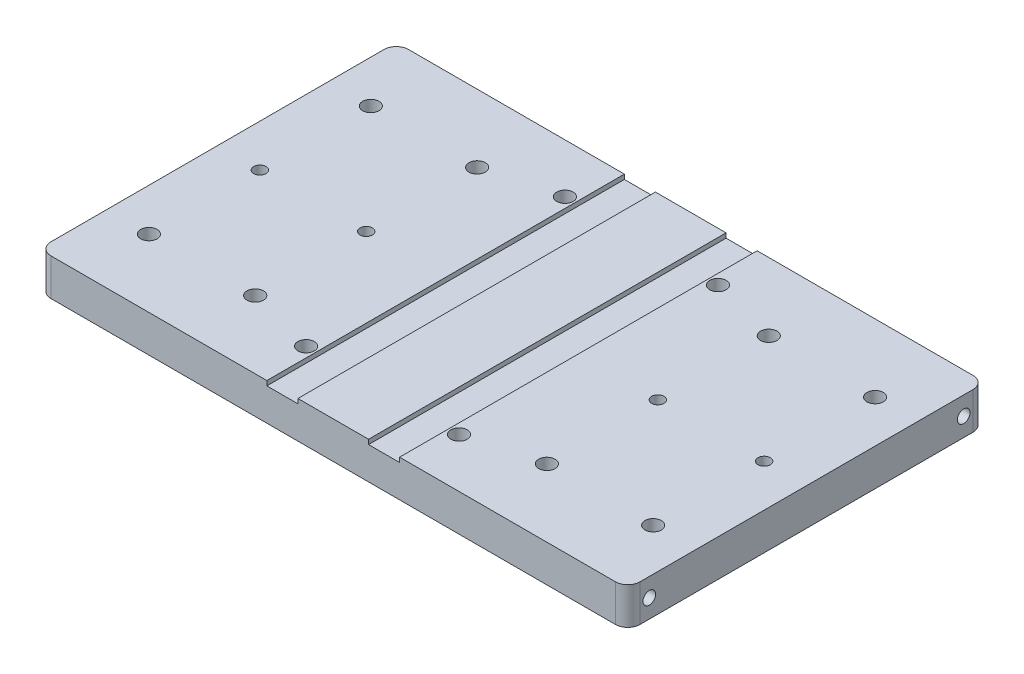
ISO-10303-21;
HEADER;
FILE_DESCRIPTION(('STEP AP214'),'2;1');
FILE_NAME('part.step','',(''),(''),'','','');
FILE_SCHEMA(('AUTOMOTIVE_DESIGN { 1 0 10303 214 1 1 1 1 }'));
ENDSEC;
DATA;
#1=APPLICATION_CONTEXT('core data for automotive mechanical design processes');
#2=APPLICATION_PROTOCOL_DEFINITION('international standard','automotive_design',2000,#1);
#3=PRODUCT_CONTEXT('',#1,'mechanical');
#4=PRODUCT('Part','Part','',(#3));
#5=PRODUCT_RELATED_PRODUCT_CATEGORY('part','',(#4));
#6=PRODUCT_DEFINITION_FORMATION('','',#4);
#7=PRODUCT_DEFINITION_CONTEXT('part definition',#1,'design');
#8=PRODUCT_DEFINITION('design','',#6,#7);
#9=PRODUCT_DEFINITION_SHAPE('','',#8);
#10=(LENGTH_UNIT() NAMED_UNIT(*) SI_UNIT(.MILLI.,.METRE.));
#11=(NAMED_UNIT(*) PLANE_ANGLE_UNIT() SI_UNIT($,.RADIAN.));
#12=(NAMED_UNIT(*) SI_UNIT($,.STERADIAN.) SOLID_ANGLE_UNIT());
#13=UNCERTAINTY_MEASURE_WITH_UNIT(LENGTH_MEASURE(1.E-05),#10,'distance_accuracy_value','');
#14=(GEOMETRIC_REPRESENTATION_CONTEXT(3) GLOBAL_UNCERTAINTY_ASSIGNED_CONTEXT((#13)) GLOBAL_UNIT_ASSIGNED_CONTEXT((#10,
#11,#12)) REPRESENTATION_CONTEXT('',''));
#15=CARTESIAN_POINT('',(0.,0.,0.));
#16=DIRECTION('',(0.,0.,1.));
#17=DIRECTION('',(1.,0.,0.));
#18=AXIS2_PLACEMENT_3D('',#15,#16,#17);
#19=CARTESIAN_POINT('',(0.,9.525,0.));
#20=DIRECTION('',(0.,1.,0.));
#21=DIRECTION('',(0.,0.,1.));
#22=AXIS2_PLACEMENT_3D('',#19,#20,#21);
#23=PLANE('',#22);
#24=CARTESIAN_POINT('',(-129.870200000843,9.525,1.07402872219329E-11));
#25=DIRECTION('',(0.,1.,0.));
#26=DIRECTION('',(0.,0.,1.));
#27=AXIS2_PLACEMENT_3D('',#24,#25,#26);
#28=CIRCLE('',#27,3.17500000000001);
#29=CARTESIAN_POINT('',(-129.870200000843,9.525,3.17500000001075));
#30=VERTEX_POINT('',#29);
#31=EDGE_CURVE('E193',#30,#30,#28,.T.);
#32=ORIENTED_EDGE('',*,*,#31,.F.);
#33=EDGE_LOOP('',(#32));
#34=FACE_BOUND('',#33,.T.);
#35=CARTESIAN_POINT('',(-75.1078000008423,9.525,1.03738215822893E-11));
#36=DIRECTION('',(0.,1.,0.));
#37=DIRECTION('',(0.,0.,1.));
#38=AXIS2_PLACEMENT_3D('',#35,#36,#37);
#39=CIRCLE('',#38,3.175);
#40=CARTESIAN_POINT('',(-75.1078000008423,9.525,3.17500000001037));
#41=VERTEX_POINT('',#40);
#42=EDGE_CURVE('E199',#41,#41,#39,.T.);
#43=ORIENTED_EDGE('',*,*,#42,.F.);
#44=EDGE_LOOP('',(#43));
#45=FACE_BOUND('',#44,.T.);
#46=CARTESIAN_POINT('',(-129.870200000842,9.52500000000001,57.1500000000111));
#47=DIRECTION('',(0.,-1.,0.));
#48=DIRECTION('',(0.,0.,-1.));
#49=AXIS2_PLACEMENT_3D('',#46,#47,#48);
#50=CIRCLE('',#49,4.21640000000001);
#51=CARTESIAN_POINT('',(-129.870200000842,9.52500000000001,52.9336000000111));
#52=VERTEX_POINT('',#51);
#53=EDGE_CURVE('E238',#52,#52,#50,.T.);
#54=ORIENTED_EDGE('',*,*,#53,.T.);
#55=EDGE_LOOP('',(#54));
#56=FACE_BOUND('',#55,.T.);
#57=DIRECTION('',(0.,0.,1.));
#58=VECTOR('',#57,1.);
#59=CARTESIAN_POINT('',(-151.6888,9.525,-92.075));
#60=LINE('',#59,#58);
#61=CARTESIAN_POINT('',(-151.6888,9.525,-85.725));
#62=VERTEX_POINT('',#61);
#63=CARTESIAN_POINT('',(-151.6888,9.525,85.725));
#64=VERTEX_POINT('',#63);
#65=EDGE_CURVE('E421',#62,#64,#60,.T.);
#66=ORIENTED_EDGE('',*,*,#65,.T.);
#67=CARTESIAN_POINT('',(-145.3388,9.525,85.725));
#68=DIRECTION('',(0.,1.,0.));
#69=DIRECTION('',(0.,0.,1.));
#70=AXIS2_PLACEMENT_3D('',#67,#68,#69);
#71=CIRCLE('',#70,6.35);
#72=CARTESIAN_POINT('',(-145.3388,9.525,92.075));
#73=VERTEX_POINT('',#72);
#74=EDGE_CURVE('E458',#64,#73,#71,.T.);
#75=ORIENTED_EDGE('',*,*,#74,.T.);
#76=DIRECTION('',(1.,0.,0.));
#77=VECTOR('',#76,1.);
#78=CARTESIAN_POINT('',(-151.6888,9.525,92.075));
#79=LINE('',#78,#77);
#80=CARTESIAN_POINT('',(-34.1884,9.52500000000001,92.075));
#81=VERTEX_POINT('',#80);
#82=EDGE_CURVE('E426',#73,#81,#79,.T.);
#83=ORIENTED_EDGE('',*,*,#82,.T.);
#84=DIRECTION('',(0.,0.,-1.));
#85=VECTOR('',#84,1.);
#86=CARTESIAN_POINT('',(-34.1884,9.52500000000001,92.075));
#87=LINE('',#86,#85);
#88=CARTESIAN_POINT('',(-34.1884,9.525,-92.075));
#89=VERTEX_POINT('',#88);
#90=EDGE_CURVE('E411',#81,#89,#87,.T.);
#91=ORIENTED_EDGE('',*,*,#90,.T.);
#92=DIRECTION('',(-1.,0.,0.));
#93=VECTOR('',#92,1.);
#94=CARTESIAN_POINT('',(-151.6888,9.525,-92.075));
#95=LINE('',#94,#93);
#96=CARTESIAN_POINT('',(-145.3388,9.525,-92.075));
#97=VERTEX_POINT('',#96);
#98=EDGE_CURVE('E417',#89,#97,#95,.T.);
#99=ORIENTED_EDGE('',*,*,#98,.T.);
#100=CARTESIAN_POINT('',(-145.3388,9.525,-85.725));
#101=DIRECTION('',(0.,1.,0.));
#102=DIRECTION('',(0.,0.,1.));
#103=AXIS2_PLACEMENT_3D('',#100,#101,#102);
#104=CIRCLE('',#103,6.35);
#105=EDGE_CURVE('E456',#97,#62,#104,.T.);
#106=ORIENTED_EDGE('',*,*,#105,.T.);
#107=EDGE_LOOP('',(#66,#75,#83,#91,#99,#106));
#108=FACE_BOUND('',#107,.T.);
#109=CARTESIAN_POINT('',(-39.3954000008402,9.52500000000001,66.6750000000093));
#110=DIRECTION('',(0.,-1.,0.));
#111=DIRECTION('',(0.,0.,-1.));
#112=AXIS2_PLACEMENT_3D('',#109,#110,#111);
#113=CIRCLE('',#112,4.21639999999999);
#114=CARTESIAN_POINT('',(-39.3954000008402,9.52500000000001,62.4586000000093));
#115=VERTEX_POINT('',#114);
#116=EDGE_CURVE('E334',#115,#115,#113,.T.);
#117=ORIENTED_EDGE('',*,*,#116,.T.);
#118=EDGE_LOOP('',(#117));
#119=FACE_BOUND('',#118,.T.);
#120=CARTESIAN_POINT('',(-39.3954000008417,9.52500000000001,-66.6749999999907));
#121=DIRECTION('',(0.,-1.,0.));
#122=DIRECTION('',(0.,0.,-1.));
#123=AXIS2_PLACEMENT_3D('',#120,#121,#122);
#124=CIRCLE('',#123,4.21639999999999);
#125=CARTESIAN_POINT('',(-39.3954000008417,9.52500000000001,-70.8913999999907));
#126=VERTEX_POINT('',#125);
#127=EDGE_CURVE('E322',#126,#126,#124,.T.);
#128=ORIENTED_EDGE('',*,*,#127,.T.);
#129=EDGE_LOOP('',(#128));
#130=FACE_BOUND('',#129,.T.);
#131=CARTESIAN_POINT('',(-129.870200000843,9.52500000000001,-57.1499999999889));
#132=DIRECTION('',(0.,-1.,0.));
#133=DIRECTION('',(0.,0.,-1.));
#134=AXIS2_PLACEMENT_3D('',#131,#132,#133);
#135=CIRCLE('',#134,4.21639999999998);
#136=CARTESIAN_POINT('',(-129.870200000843,9.52500000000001,-61.3663999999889));
#137=VERTEX_POINT('',#136);
#138=EDGE_CURVE('E250',#137,#137,#135,.T.);
#139=ORIENTED_EDGE('',*,*,#138,.T.);
#140=EDGE_LOOP('',(#139));
#141=FACE_BOUND('',#140,.T.);
#142=CARTESIAN_POINT('',(-75.1078000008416,9.52500000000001,57.1500000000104));
#143=DIRECTION('',(0.,-1.,0.));
#144=DIRECTION('',(0.,0.,-1.));
#145=AXIS2_PLACEMENT_3D('',#142,#143,#144);
#146=CIRCLE('',#145,4.21639999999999);
#147=CARTESIAN_POINT('',(-75.1078000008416,9.52500000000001,52.9336000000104));
#148=VERTEX_POINT('',#147);
#149=EDGE_CURVE('E226',#148,#148,#146,.T.);
#150=ORIENTED_EDGE('',*,*,#149,.T.);
#151=EDGE_LOOP('',(#150));
#152=FACE_BOUND('',#151,.T.);
#153=CARTESIAN_POINT('',(-75.1078000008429,9.52500000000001,-57.1499999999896));
#154=DIRECTION('',(0.,-1.,0.));
#155=DIRECTION('',(0.,0.,-1.));
#156=AXIS2_PLACEMENT_3D('',#153,#154,#155);
#157=CIRCLE('',#156,4.21639999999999);
#158=CARTESIAN_POINT('',(-75.1078000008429,9.52500000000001,-61.3663999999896));
#159=VERTEX_POINT('',#158);
#160=EDGE_CURVE('E214',#159,#159,#157,.T.);
#161=ORIENTED_EDGE('',*,*,#160,.T.);
#162=EDGE_LOOP('',(#161));
#163=FACE_BOUND('',#162,.T.);
#164=ADVANCED_FACE('F37',(#34,#45,#56,#108,#119,#130,#141,#152,#163),#23,.T.);
#165=DIRECTION('',(0.,0.,-1.));
#166=VECTOR('',#165,1.);
#167=CARTESIAN_POINT('',(18.1864,9.525,92.075));
#168=LINE('',#167,#166);
#169=CARTESIAN_POINT('',(18.1864,9.525,92.075));
#170=VERTEX_POINT('',#169);
#171=CARTESIAN_POINT('',(18.1864,9.525,-92.075));
#172=VERTEX_POINT('',#171);
#173=EDGE_CURVE('E372',#170,#172,#168,.T.);
#174=ORIENTED_EDGE('',*,*,#173,.T.);
#175=CARTESIAN_POINT('',(-18.1864,9.52500000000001,-92.075));
#176=VERTEX_POINT('',#175);
#177=EDGE_CURVE('E422',#172,#176,#95,.T.);
#178=ORIENTED_EDGE('',*,*,#177,.T.);
#179=DIRECTION('',(0.,0.,-1.));
#180=VECTOR('',#179,1.);
#181=CARTESIAN_POINT('',(-18.1864,9.52500000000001,92.075));
#182=LINE('',#181,#180);
#183=CARTESIAN_POINT('',(-18.1864,9.52500000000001,92.075));
#184=VERTEX_POINT('',#183);
#185=EDGE_CURVE('E409',#184,#176,#182,.T.);
#186=ORIENTED_EDGE('',*,*,#185,.F.);
#187=EDGE_CURVE('E429',#184,#170,#79,.T.);
#188=ORIENTED_EDGE('',*,*,#187,.T.);
#189=EDGE_LOOP('',(#174,#178,#186,#188));
#190=FACE_BOUND('',#189,.T.);
#191=ADVANCED_FACE('F500',(#190),#23,.T.);
#192=CARTESIAN_POINT('',(129.870200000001,9.525,2.5682243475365E-11));
#193=DIRECTION('',(0.,1.,0.));
#194=DIRECTION('',(0.,0.,1.));
#195=AXIS2_PLACEMENT_3D('',#192,#193,#194);
#196=CIRCLE('',#195,3.17500000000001);
#197=CARTESIAN_POINT('',(129.870200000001,9.525,3.17500000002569));
#198=VERTEX_POINT('',#197);
#199=EDGE_CURVE('E181',#198,#198,#196,.T.);
#200=ORIENTED_EDGE('',*,*,#199,.F.);
#201=EDGE_LOOP('',(#200));
#202=FACE_BOUND('',#201,.T.);
#203=CARTESIAN_POINT('',(75.1078000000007,9.525,2.56928832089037E-11));
#204=DIRECTION('',(0.,1.,0.));
#205=DIRECTION('',(0.,0.,1.));
#206=AXIS2_PLACEMENT_3D('',#203,#204,#205);
#207=CIRCLE('',#206,3.175);
#208=CARTESIAN_POINT('',(75.1078000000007,9.525,3.17500000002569));
#209=VERTEX_POINT('',#208);
#210=EDGE_CURVE('E187',#209,#209,#207,.T.);
#211=ORIENTED_EDGE('',*,*,#210,.F.);
#212=EDGE_LOOP('',(#211));
#213=FACE_BOUND('',#212,.T.);
#214=CARTESIAN_POINT('',(129.870200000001,9.52500000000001,57.1500000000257));
#215=DIRECTION('',(0.,-1.,0.));
#216=DIRECTION('',(0.,0.,-1.));
#217=AXIS2_PLACEMENT_3D('',#214,#215,#216);
#218=CIRCLE('',#217,4.21640000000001);
#219=CARTESIAN_POINT('',(129.870200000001,9.52500000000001,52.9336000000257));
#220=VERTEX_POINT('',#219);
#221=EDGE_CURVE('E262',#220,#220,#218,.T.);
#222=ORIENTED_EDGE('',*,*,#221,.T.);
#223=EDGE_LOOP('',(#222));
#224=FACE_BOUND('',#223,.T.);
#225=CARTESIAN_POINT('',(129.870200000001,9.52500000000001,-57.1499999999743));
#226=DIRECTION('',(0.,-1.,0.));
#227=DIRECTION('',(0.,0.,-1.));
#228=AXIS2_PLACEMENT_3D('',#225,#226,#227);
#229=CIRCLE('',#228,4.21640000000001);
#230=CARTESIAN_POINT('',(129.870200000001,9.52500000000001,-61.3663999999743));
#231=VERTEX_POINT('',#230);
#232=EDGE_CURVE('E274',#231,#231,#229,.T.);
#233=ORIENTED_EDGE('',*,*,#232,.T.);
#234=EDGE_LOOP('',(#233));
#235=FACE_BOUND('',#234,.T.);
#236=CARTESIAN_POINT('',(75.1078000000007,9.52500000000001,57.1500000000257));
#237=DIRECTION('',(0.,-1.,0.));
#238=DIRECTION('',(0.,0.,-1.));
#239=AXIS2_PLACEMENT_3D('',#236,#237,#238);
#240=CIRCLE('',#239,4.21639999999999);
#241=CARTESIAN_POINT('',(75.1078000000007,9.52500000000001,52.9336000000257));
#242=VERTEX_POINT('',#241);
#243=EDGE_CURVE('E286',#242,#242,#240,.T.);
#244=ORIENTED_EDGE('',*,*,#243,.T.);
#245=EDGE_LOOP('',(#244));
#246=FACE_BOUND('',#245,.T.);
#247=CARTESIAN_POINT('',(75.1078000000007,9.52500000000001,-57.1499999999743));
#248=DIRECTION('',(0.,-1.,0.));
#249=DIRECTION('',(0.,0.,-1.));
#250=AXIS2_PLACEMENT_3D('',#247,#248,#249);
#251=CIRCLE('',#250,4.21639999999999);
#252=CARTESIAN_POINT('',(75.1078000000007,9.52500000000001,-61.3663999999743));
#253=VERTEX_POINT('',#252);
#254=EDGE_CURVE('E298',#253,#253,#251,.T.);
#255=ORIENTED_EDGE('',*,*,#254,.T.);
#256=EDGE_LOOP('',(#255));
#257=FACE_BOUND('',#256,.T.);
#258=CARTESIAN_POINT('',(39.3954000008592,9.52500000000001,66.6750000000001));
#259=DIRECTION('',(0.,-1.,0.));
#260=DIRECTION('',(0.,0.,-1.));
#261=AXIS2_PLACEMENT_3D('',#258,#259,#260);
#262=CIRCLE('',#261,4.21639999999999);
#263=CARTESIAN_POINT('',(39.3954000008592,9.52500000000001,62.4586000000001));
#264=VERTEX_POINT('',#263);
#265=EDGE_CURVE('E346',#264,#264,#262,.T.);
#266=ORIENTED_EDGE('',*,*,#265,.T.);
#267=EDGE_LOOP('',(#266));
#268=FACE_BOUND('',#267,.T.);
#269=CARTESIAN_POINT('',(39.3954000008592,9.52500000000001,-66.675));
#270=DIRECTION('',(0.,-1.,0.));
#271=DIRECTION('',(0.,0.,-1.));
#272=AXIS2_PLACEMENT_3D('',#269,#270,#271);
#273=CIRCLE('',#272,4.21639999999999);
#274=CARTESIAN_POINT('',(39.3954000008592,9.52500000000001,-70.8914));
#275=VERTEX_POINT('',#274);
#276=EDGE_CURVE('E358',#275,#275,#273,.T.);
#277=ORIENTED_EDGE('',*,*,#276,.T.);
#278=EDGE_LOOP('',(#277));
#279=FACE_BOUND('',#278,.T.);
#280=DIRECTION('',(0.,0.,-1.));
#281=VECTOR('',#280,1.);
#282=CARTESIAN_POINT('',(151.6888,9.525,-92.075));
#283=LINE('',#282,#281);
#284=CARTESIAN_POINT('',(151.6888,9.525,85.725));
#285=VERTEX_POINT('',#284);
#286=CARTESIAN_POINT('',(151.6888,9.525,-85.725));
#287=VERTEX_POINT('',#286);
#288=EDGE_CURVE('E415',#285,#287,#283,.T.);
#289=ORIENTED_EDGE('',*,*,#288,.T.);
#290=CARTESIAN_POINT('',(145.3388,9.525,-85.725));
#291=DIRECTION('',(0.,1.,0.));
#292=DIRECTION('',(0.,0.,1.));
#293=AXIS2_PLACEMENT_3D('',#290,#291,#292);
#294=CIRCLE('',#293,6.35);
#295=CARTESIAN_POINT('',(145.3388,9.525,-92.075));
#296=VERTEX_POINT('',#295);
#297=EDGE_CURVE('E11',#287,#296,#294,.T.);
#298=ORIENTED_EDGE('',*,*,#297,.T.);
#299=CARTESIAN_POINT('',(34.1884,9.525,-92.075));
#300=VERTEX_POINT('',#299);
#301=EDGE_CURVE('E419',#296,#300,#95,.T.);
#302=ORIENTED_EDGE('',*,*,#301,.T.);
#303=DIRECTION('',(0.,0.,-1.));
#304=VECTOR('',#303,1.);
#305=CARTESIAN_POINT('',(34.1884,9.525,92.075));
#306=LINE('',#305,#304);
#307=CARTESIAN_POINT('',(34.1884,9.525,92.075));
#308=VERTEX_POINT('',#307);
#309=EDGE_CURVE('E386',#308,#300,#306,.T.);
#310=ORIENTED_EDGE('',*,*,#309,.F.);
#311=CARTESIAN_POINT('',(145.3388,9.525,92.075));
#312=VERTEX_POINT('',#311);
#313=EDGE_CURVE('E425',#308,#312,#79,.T.);
#314=ORIENTED_EDGE('',*,*,#313,.T.);
#315=CARTESIAN_POINT('',(145.3388,9.525,85.725));
#316=DIRECTION('',(0.,1.,0.));
#317=DIRECTION('',(0.,0.,1.));
#318=AXIS2_PLACEMENT_3D('',#315,#316,#317);
#319=CIRCLE('',#318,6.35);
#320=EDGE_CURVE('E45',#312,#285,#319,.T.);
#321=ORIENTED_EDGE('',*,*,#320,.T.);
#322=EDGE_LOOP('',(#289,#298,#302,#310,#314,#321));
#323=FACE_BOUND('',#322,.T.);
#324=ADVANCED_FACE('F487',(#202,#213,#224,#235,#246,#257,#268,#279,#323),#23,.T.);
#325=CARTESIAN_POINT('',(151.6888,9.525,-92.075));
#326=DIRECTION('',(-1.,0.,0.));
#327=DIRECTION('',(0.,0.,1.));
#328=AXIS2_PLACEMENT_3D('',#325,#326,#327);
#329=PLANE('',#328);
#330=CARTESIAN_POINT('',(151.6888,0.,80.9625));
#331=DIRECTION('',(1.,0.,0.));
#332=DIRECTION('',(0.,0.,-1.));
#333=AXIS2_PLACEMENT_3D('',#330,#331,#332);
#334=CIRCLE('',#333,3.2639);
#335=CARTESIAN_POINT('',(151.6888,0.,77.6986));
#336=VERTEX_POINT('',#335);
#337=EDGE_CURVE('E301',#336,#336,#334,.T.);
#338=ORIENTED_EDGE('',*,*,#337,.F.);
#339=EDGE_LOOP('',(#338));
#340=FACE_BOUND('',#339,.T.);
#341=CARTESIAN_POINT('',(151.6888,0.,-80.9625));
#342=DIRECTION('',(1.,0.,0.));
#343=DIRECTION('',(0.,0.,-1.));
#344=AXIS2_PLACEMENT_3D('',#341,#342,#343);
#345=CIRCLE('',#344,3.2639);
#346=CARTESIAN_POINT('',(151.6888,0.,-84.2264));
#347=VERTEX_POINT('',#346);
#348=EDGE_CURVE('E307',#347,#347,#345,.T.);
#349=ORIENTED_EDGE('',*,*,#348,.F.);
#350=EDGE_LOOP('',(#349));
#351=FACE_BOUND('',#350,.T.);
#352=DIRECTION('',(0.,0.,-1.));
#353=VECTOR('',#352,1.);
#354=CARTESIAN_POINT('',(151.6888,-9.525,-92.075));
#355=LINE('',#354,#353);
#356=CARTESIAN_POINT('',(151.6888,-9.525,85.725));
#357=VERTEX_POINT('',#356);
#358=CARTESIAN_POINT('',(151.6888,-9.525,-85.725));
#359=VERTEX_POINT('',#358);
#360=EDGE_CURVE('E383',#357,#359,#355,.T.);
#361=ORIENTED_EDGE('',*,*,#360,.T.);
#362=DIRECTION('',(0.,-1.,0.));
#363=VECTOR('',#362,1.);
#364=CARTESIAN_POINT('',(151.6888,9.525,-85.725));
#365=LINE('',#364,#363);
#366=EDGE_CURVE('E52',#359,#287,#365,.F.);
#367=ORIENTED_EDGE('',*,*,#366,.T.);
#368=ORIENTED_EDGE('',*,*,#288,.F.);
#369=DIRECTION('',(0.,-1.,0.));
#370=VECTOR('',#369,1.);
#371=CARTESIAN_POINT('',(151.6888,9.525,85.725));
#372=LINE('',#371,#370);
#373=EDGE_CURVE('E465',#285,#357,#372,.T.);
#374=ORIENTED_EDGE('',*,*,#373,.T.);
#375=EDGE_LOOP('',(#361,#367,#368,#374));
#376=FACE_BOUND('',#375,.T.);
#377=ADVANCED_FACE('F470',(#340,#351,#376),#329,.F.);
#378=CARTESIAN_POINT('',(-151.6888,9.525,-92.075));
#379=DIRECTION('',(0.,0.,1.));
#380=DIRECTION('',(1.,0.,0.));
#381=AXIS2_PLACEMENT_3D('',#378,#379,#380);
#382=PLANE('',#381);
#383=DIRECTION('',(-1.,0.,0.));
#384=VECTOR('',#383,1.);
#385=CARTESIAN_POINT('',(-151.6888,-9.525,-92.075));
#386=LINE('',#385,#384);
#387=CARTESIAN_POINT('',(145.3388,-9.525,-92.075));
#388=VERTEX_POINT('',#387);
#389=CARTESIAN_POINT('',(-145.3388,-9.525,-92.075));
#390=VERTEX_POINT('',#389);
#391=EDGE_CURVE('E431',#388,#390,#386,.T.);
#392=ORIENTED_EDGE('',*,*,#391,.T.);
#393=DIRECTION('',(0.,-1.,0.));
#394=VECTOR('',#393,1.);
#395=CARTESIAN_POINT('',(-145.3388,9.525,-92.075));
#396=LINE('',#395,#394);
#397=EDGE_CURVE('E463',#390,#97,#396,.F.);
#398=ORIENTED_EDGE('',*,*,#397,.T.);
#399=ORIENTED_EDGE('',*,*,#98,.F.);
#400=DIRECTION('',(0.,1.,0.));
#401=VECTOR('',#400,1.);
#402=CARTESIAN_POINT('',(-34.1884,7.13899257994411,-92.075));
#403=LINE('',#402,#401);
#404=CARTESIAN_POINT('',(-34.1884,7.13899257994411,-92.075));
#405=VERTEX_POINT('',#404);
#406=EDGE_CURVE('E404',#405,#89,#403,.T.);
#407=ORIENTED_EDGE('',*,*,#406,.F.);
#408=DIRECTION('',(-1.,0.,0.));
#409=VECTOR('',#408,1.);
#410=CARTESIAN_POINT('',(-18.1864,7.1389925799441,-92.075));
#411=LINE('',#410,#409);
#412=CARTESIAN_POINT('',(-18.1864,7.1389925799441,-92.075));
#413=VERTEX_POINT('',#412);
#414=EDGE_CURVE('E361',#413,#405,#411,.T.);
#415=ORIENTED_EDGE('',*,*,#414,.F.);
#416=DIRECTION('',(0.,-1.,0.));
#417=VECTOR('',#416,1.);
#418=CARTESIAN_POINT('',(-18.1864,7.1389925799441,-92.075));
#419=LINE('',#418,#417);
#420=EDGE_CURVE('E395',#176,#413,#419,.T.);
#421=ORIENTED_EDGE('',*,*,#420,.F.);
#422=ORIENTED_EDGE('',*,*,#177,.F.);
#423=DIRECTION('',(0.,1.,0.));
#424=VECTOR('',#423,1.);
#425=CARTESIAN_POINT('',(18.1864,7.1389925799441,-92.075));
#426=LINE('',#425,#424);
#427=CARTESIAN_POINT('',(18.1864,7.1389925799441,-92.075));
#428=VERTEX_POINT('',#427);
#429=EDGE_CURVE('E373',#428,#172,#426,.T.);
#430=ORIENTED_EDGE('',*,*,#429,.F.);
#431=DIRECTION('',(-1.,0.,0.));
#432=VECTOR('',#431,1.);
#433=CARTESIAN_POINT('',(18.1864,7.1389925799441,-92.075));
#434=LINE('',#433,#432);
#435=CARTESIAN_POINT('',(34.1884,7.1389925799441,-92.075));
#436=VERTEX_POINT('',#435);
#437=EDGE_CURVE('E366',#436,#428,#434,.T.);
#438=ORIENTED_EDGE('',*,*,#437,.F.);
#439=DIRECTION('',(0.,-1.,0.));
#440=VECTOR('',#439,1.);
#441=CARTESIAN_POINT('',(34.1884,7.1389925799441,-92.075));
#442=LINE('',#441,#440);
#443=EDGE_CURVE('E375',#300,#436,#442,.T.);
#444=ORIENTED_EDGE('',*,*,#443,.F.);
#445=ORIENTED_EDGE('',*,*,#301,.F.);
#446=DIRECTION('',(0.,-1.,0.));
#447=VECTOR('',#446,1.);
#448=CARTESIAN_POINT('',(145.3388,9.525,-92.075));
#449=LINE('',#448,#447);
#450=EDGE_CURVE('E460',#296,#388,#449,.T.);
#451=ORIENTED_EDGE('',*,*,#450,.T.);
#452=EDGE_LOOP('',(#392,#398,#399,#407,#415,#421,#422,#430,#438,#444,#445,#451));
#453=FACE_BOUND('',#452,.T.);
#454=ADVANCED_FACE('F482',(#453),#382,.F.);
#455=CARTESIAN_POINT('',(-151.6888,9.525,-92.075));
#456=DIRECTION('',(1.,0.,0.));
#457=DIRECTION('',(0.,0.,-1.));
#458=AXIS2_PLACEMENT_3D('',#455,#456,#457);
#459=PLANE('',#458);
#460=CARTESIAN_POINT('',(-151.6888,0.,80.9625));
#461=DIRECTION('',(-1.,0.,0.));
#462=DIRECTION('',(0.,0.,1.));
#463=AXIS2_PLACEMENT_3D('',#460,#461,#462);
#464=CIRCLE('',#463,3.2639);
#465=CARTESIAN_POINT('',(-151.6888,0.,84.2264));
#466=VERTEX_POINT('',#465);
#467=EDGE_CURVE('E171',#466,#466,#464,.T.);
#468=ORIENTED_EDGE('',*,*,#467,.F.);
#469=EDGE_LOOP('',(#468));
#470=FACE_BOUND('',#469,.T.);
#471=CARTESIAN_POINT('',(-151.6888,0.,-80.9625));
#472=DIRECTION('',(-1.,0.,0.));
#473=DIRECTION('',(0.,0.,1.));
#474=AXIS2_PLACEMENT_3D('',#471,#472,#473);
#475=CIRCLE('',#474,3.2639);
#476=CARTESIAN_POINT('',(-151.6888,0.,-77.6986));
#477=VERTEX_POINT('',#476);
#478=EDGE_CURVE('E170',#477,#477,#475,.T.);
#479=ORIENTED_EDGE('',*,*,#478,.F.);
#480=EDGE_LOOP('',(#479));
#481=FACE_BOUND('',#480,.T.);
#482=DIRECTION('',(0.,0.,1.));
#483=VECTOR('',#482,1.);
#484=CARTESIAN_POINT('',(-151.6888,-9.525,-92.075));
#485=LINE('',#484,#483);
#486=CARTESIAN_POINT('',(-151.6888,-9.525,-85.725));
#487=VERTEX_POINT('',#486);
#488=CARTESIAN_POINT('',(-151.6888,-9.525,85.725));
#489=VERTEX_POINT('',#488);
#490=EDGE_CURVE('E434',#487,#489,#485,.T.);
#491=ORIENTED_EDGE('',*,*,#490,.T.);
#492=DIRECTION('',(0.,-1.,0.));
#493=VECTOR('',#492,1.);
#494=CARTESIAN_POINT('',(-151.6888,9.525,85.725));
#495=LINE('',#494,#493);
#496=EDGE_CURVE('E454',#489,#64,#495,.F.);
#497=ORIENTED_EDGE('',*,*,#496,.T.);
#498=ORIENTED_EDGE('',*,*,#65,.F.);
#499=DIRECTION('',(0.,-1.,0.));
#500=VECTOR('',#499,1.);
#501=CARTESIAN_POINT('',(-151.6888,9.525,-85.725));
#502=LINE('',#501,#500);
#503=EDGE_CURVE('E451',#62,#487,#502,.T.);
#504=ORIENTED_EDGE('',*,*,#503,.T.);
#505=EDGE_LOOP('',(#491,#497,#498,#504));
#506=FACE_BOUND('',#505,.T.);
#507=ADVANCED_FACE('F522',(#470,#481,#506),#459,.F.);
#508=CARTESIAN_POINT('',(-151.6888,9.525,92.075));
#509=DIRECTION('',(0.,0.,-1.));
#510=DIRECTION('',(-1.,0.,0.));
#511=AXIS2_PLACEMENT_3D('',#508,#509,#510);
#512=PLANE('',#511);
#513=ORIENTED_EDGE('',*,*,#82,.F.);
#514=DIRECTION('',(0.,-1.,0.));
#515=VECTOR('',#514,1.);
#516=CARTESIAN_POINT('',(-145.3388,9.525,92.075));
#517=LINE('',#516,#515);
#518=CARTESIAN_POINT('',(-145.3388,-9.525,92.075));
#519=VERTEX_POINT('',#518);
#520=EDGE_CURVE('E440',#73,#519,#517,.T.);
#521=ORIENTED_EDGE('',*,*,#520,.T.);
#522=DIRECTION('',(1.,0.,0.));
#523=VECTOR('',#522,1.);
#524=CARTESIAN_POINT('',(-151.6888,-9.525,92.075));
#525=LINE('',#524,#523);
#526=CARTESIAN_POINT('',(145.3388,-9.525,92.075));
#527=VERTEX_POINT('',#526);
#528=EDGE_CURVE('E418',#519,#527,#525,.T.);
#529=ORIENTED_EDGE('',*,*,#528,.T.);
#530=DIRECTION('',(0.,-1.,0.));
#531=VECTOR('',#530,1.);
#532=CARTESIAN_POINT('',(145.3388,9.525,92.075));
#533=LINE('',#532,#531);
#534=EDGE_CURVE('E428',#527,#312,#533,.F.);
#535=ORIENTED_EDGE('',*,*,#534,.T.);
#536=ORIENTED_EDGE('',*,*,#313,.F.);
#537=DIRECTION('',(0.,-1.,0.));
#538=VECTOR('',#537,1.);
#539=CARTESIAN_POINT('',(34.1884,7.1389925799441,92.075));
#540=LINE('',#539,#538);
#541=CARTESIAN_POINT('',(34.1884,7.1389925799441,92.075));
#542=VERTEX_POINT('',#541);
#543=EDGE_CURVE('E365',#308,#542,#540,.T.);
#544=ORIENTED_EDGE('',*,*,#543,.T.);
#545=DIRECTION('',(-1.,0.,0.));
#546=VECTOR('',#545,1.);
#547=CARTESIAN_POINT('',(18.1864,7.1389925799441,92.075));
#548=LINE('',#547,#546);
#549=CARTESIAN_POINT('',(18.1864,7.1389925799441,92.075));
#550=VERTEX_POINT('',#549);
#551=EDGE_CURVE('E369',#542,#550,#548,.T.);
#552=ORIENTED_EDGE('',*,*,#551,.T.);
#553=DIRECTION('',(0.,1.,0.));
#554=VECTOR('',#553,1.);
#555=CARTESIAN_POINT('',(18.1864,7.1389925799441,92.075));
#556=LINE('',#555,#554);
#557=EDGE_CURVE('E362',#550,#170,#556,.T.);
#558=ORIENTED_EDGE('',*,*,#557,.T.);
#559=ORIENTED_EDGE('',*,*,#187,.F.);
#560=DIRECTION('',(0.,-1.,0.));
#561=VECTOR('',#560,1.);
#562=CARTESIAN_POINT('',(-18.1864,7.1389925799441,92.075));
#563=LINE('',#562,#561);
#564=CARTESIAN_POINT('',(-18.1864,7.1389925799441,92.075));
#565=VERTEX_POINT('',#564);
#566=EDGE_CURVE('E398',#184,#565,#563,.T.);
#567=ORIENTED_EDGE('',*,*,#566,.T.);
#568=DIRECTION('',(-1.,0.,0.));
#569=VECTOR('',#568,1.);
#570=CARTESIAN_POINT('',(-18.1864,7.1389925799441,92.075));
#571=LINE('',#570,#569);
#572=CARTESIAN_POINT('',(-34.1884,7.13899257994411,92.075));
#573=VERTEX_POINT('',#572);
#574=EDGE_CURVE('E391',#565,#573,#571,.T.);
#575=ORIENTED_EDGE('',*,*,#574,.T.);
#576=DIRECTION('',(0.,1.,0.));
#577=VECTOR('',#576,1.);
#578=CARTESIAN_POINT('',(-34.1884,7.13899257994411,92.075));
#579=LINE('',#578,#577);
#580=EDGE_CURVE('E394',#573,#81,#579,.T.);
#581=ORIENTED_EDGE('',*,*,#580,.T.);
#582=EDGE_LOOP('',(#513,#521,#529,#535,#536,#544,#552,#558,#559,#567,#575,#581));
#583=FACE_BOUND('',#582,.T.);
#584=ADVANCED_FACE('F494',(#583),#512,.F.);
#585=CARTESIAN_POINT('',(0.,-9.525,0.));
#586=DIRECTION('',(0.,1.,0.));
#587=DIRECTION('',(0.,0.,1.));
#588=AXIS2_PLACEMENT_3D('',#585,#586,#587);
#589=PLANE('',#588);
#590=CARTESIAN_POINT('',(129.870200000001,-9.525,2.5682243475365E-11));
#591=DIRECTION('',(0.,1.,0.));
#592=DIRECTION('',(0.,0.,1.));
#593=AXIS2_PLACEMENT_3D('',#590,#591,#592);
#594=CIRCLE('',#593,3.17499999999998);
#595=CARTESIAN_POINT('',(129.870200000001,-9.525,3.17500000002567));
#596=VERTEX_POINT('',#595);
#597=EDGE_CURVE('E184',#596,#596,#594,.T.);
#598=ORIENTED_EDGE('',*,*,#597,.T.);
#599=EDGE_LOOP('',(#598));
#600=FACE_BOUND('',#599,.T.);
#601=CARTESIAN_POINT('',(75.1078000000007,-9.525,2.56928832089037E-11));
#602=DIRECTION('',(0.,1.,0.));
#603=DIRECTION('',(0.,0.,1.));
#604=AXIS2_PLACEMENT_3D('',#601,#602,#603);
#605=CIRCLE('',#604,3.175);
#606=CARTESIAN_POINT('',(75.1078000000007,-9.525,3.17500000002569));
#607=VERTEX_POINT('',#606);
#608=EDGE_CURVE('E190',#607,#607,#605,.T.);
#609=ORIENTED_EDGE('',*,*,#608,.T.);
#610=EDGE_LOOP('',(#609));
#611=FACE_BOUND('',#610,.T.);
#612=CARTESIAN_POINT('',(-129.870200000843,-9.525,1.07402872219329E-11));
#613=DIRECTION('',(0.,1.,0.));
#614=DIRECTION('',(0.,0.,1.));
#615=AXIS2_PLACEMENT_3D('',#612,#613,#614);
#616=CIRCLE('',#615,3.17499999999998);
#617=CARTESIAN_POINT('',(-129.870200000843,-9.525,3.17500000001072));
#618=VERTEX_POINT('',#617);
#619=EDGE_CURVE('E196',#618,#618,#616,.T.);
#620=ORIENTED_EDGE('',*,*,#619,.T.);
#621=EDGE_LOOP('',(#620));
#622=FACE_BOUND('',#621,.T.);
#623=CARTESIAN_POINT('',(-75.1078000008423,-9.525,1.03738215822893E-11));
#624=DIRECTION('',(0.,1.,0.));
#625=DIRECTION('',(0.,0.,1.));
#626=AXIS2_PLACEMENT_3D('',#623,#624,#625);
#627=CIRCLE('',#626,3.175);
#628=CARTESIAN_POINT('',(-75.1078000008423,-9.525,3.17500000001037));
#629=VERTEX_POINT('',#628);
#630=EDGE_CURVE('E202',#629,#629,#627,.T.);
#631=ORIENTED_EDGE('',*,*,#630,.T.);
#632=EDGE_LOOP('',(#631));
#633=FACE_BOUND('',#632,.T.);
#634=CARTESIAN_POINT('',(-75.1078000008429,-9.525,-57.1499999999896));
#635=DIRECTION('',(0.,-1.,0.));
#636=DIRECTION('',(0.,0.,-1.));
#637=AXIS2_PLACEMENT_3D('',#634,#635,#636);
#638=CIRCLE('',#637,6.74751);
#639=CARTESIAN_POINT('',(-75.1078000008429,-9.525,-63.8975099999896));
#640=VERTEX_POINT('',#639);
#641=EDGE_CURVE('E205',#640,#640,#638,.T.);
#642=ORIENTED_EDGE('',*,*,#641,.F.);
#643=EDGE_LOOP('',(#642));
#644=FACE_BOUND('',#643,.T.);
#645=CARTESIAN_POINT('',(-75.1078000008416,-9.525,57.1500000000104));
#646=DIRECTION('',(0.,-1.,0.));
#647=DIRECTION('',(0.,0.,-1.));
#648=AXIS2_PLACEMENT_3D('',#645,#646,#647);
#649=CIRCLE('',#648,6.74751);
#650=CARTESIAN_POINT('',(-75.1078000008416,-9.525,50.4024900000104));
#651=VERTEX_POINT('',#650);
#652=EDGE_CURVE('E217',#651,#651,#649,.T.);
#653=ORIENTED_EDGE('',*,*,#652,.F.);
#654=EDGE_LOOP('',(#653));
#655=FACE_BOUND('',#654,.T.);
#656=CARTESIAN_POINT('',(-129.870200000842,-9.525,57.1500000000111));
#657=DIRECTION('',(0.,-1.,0.));
#658=DIRECTION('',(0.,0.,-1.));
#659=AXIS2_PLACEMENT_3D('',#656,#657,#658);
#660=CIRCLE('',#659,6.74751);
#661=CARTESIAN_POINT('',(-129.870200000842,-9.525,50.4024900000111));
#662=VERTEX_POINT('',#661);
#663=EDGE_CURVE('E229',#662,#662,#660,.T.);
#664=ORIENTED_EDGE('',*,*,#663,.F.);
#665=EDGE_LOOP('',(#664));
#666=FACE_BOUND('',#665,.T.);
#667=CARTESIAN_POINT('',(-129.870200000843,-9.525,-57.1499999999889));
#668=DIRECTION('',(0.,-1.,0.));
#669=DIRECTION('',(0.,0.,-1.));
#670=AXIS2_PLACEMENT_3D('',#667,#668,#669);
#671=CIRCLE('',#670,6.74751);
#672=CARTESIAN_POINT('',(-129.870200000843,-9.525,-63.8975099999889));
#673=VERTEX_POINT('',#672);
#674=EDGE_CURVE('E241',#673,#673,#671,.T.);
#675=ORIENTED_EDGE('',*,*,#674,.F.);
#676=EDGE_LOOP('',(#675));
#677=FACE_BOUND('',#676,.T.);
#678=CARTESIAN_POINT('',(129.870200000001,-9.525,57.1500000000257));
#679=DIRECTION('',(0.,-1.,0.));
#680=DIRECTION('',(0.,0.,-1.));
#681=AXIS2_PLACEMENT_3D('',#678,#679,#680);
#682=CIRCLE('',#681,6.74751000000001);
#683=CARTESIAN_POINT('',(129.870200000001,-9.525,50.4024900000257));
#684=VERTEX_POINT('',#683);
#685=EDGE_CURVE('E253',#684,#684,#682,.T.);
#686=ORIENTED_EDGE('',*,*,#685,.F.);
#687=EDGE_LOOP('',(#686));
#688=FACE_BOUND('',#687,.T.);
#689=CARTESIAN_POINT('',(129.870200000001,-9.525,-57.1499999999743));
#690=DIRECTION('',(0.,-1.,0.));
#691=DIRECTION('',(0.,0.,-1.));
#692=AXIS2_PLACEMENT_3D('',#689,#690,#691);
#693=CIRCLE('',#692,6.74751000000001);
#694=CARTESIAN_POINT('',(129.870200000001,-9.525,-63.8975099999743));
#695=VERTEX_POINT('',#694);
#696=EDGE_CURVE('E265',#695,#695,#693,.T.);
#697=ORIENTED_EDGE('',*,*,#696,.F.);
#698=EDGE_LOOP('',(#697));
#699=FACE_BOUND('',#698,.T.);
#700=CARTESIAN_POINT('',(75.1078000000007,-9.525,57.1500000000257));
#701=DIRECTION('',(0.,-1.,0.));
#702=DIRECTION('',(0.,0.,-1.));
#703=AXIS2_PLACEMENT_3D('',#700,#701,#702);
#704=CIRCLE('',#703,6.74751);
#705=CARTESIAN_POINT('',(75.1078000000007,-9.525,50.4024900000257));
#706=VERTEX_POINT('',#705);
#707=EDGE_CURVE('E277',#706,#706,#704,.T.);
#708=ORIENTED_EDGE('',*,*,#707,.F.);
#709=EDGE_LOOP('',(#708));
#710=FACE_BOUND('',#709,.T.);
#711=CARTESIAN_POINT('',(75.1078000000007,-9.525,-57.1499999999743));
#712=DIRECTION('',(0.,-1.,0.));
#713=DIRECTION('',(0.,0.,-1.));
#714=AXIS2_PLACEMENT_3D('',#711,#712,#713);
#715=CIRCLE('',#714,6.74751);
#716=CARTESIAN_POINT('',(75.1078000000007,-9.525,-63.8975099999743));
#717=VERTEX_POINT('',#716);
#718=EDGE_CURVE('E289',#717,#717,#715,.T.);
#719=ORIENTED_EDGE('',*,*,#718,.F.);
#720=EDGE_LOOP('',(#719));
#721=FACE_BOUND('',#720,.T.);
#722=CARTESIAN_POINT('',(-39.3954000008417,-9.525,-66.6749999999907));
#723=DIRECTION('',(0.,-1.,0.));
#724=DIRECTION('',(0.,0.,-1.));
#725=AXIS2_PLACEMENT_3D('',#722,#723,#724);
#726=CIRCLE('',#725,6.74751);
#727=CARTESIAN_POINT('',(-39.3954000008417,-9.525,-73.4225099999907));
#728=VERTEX_POINT('',#727);
#729=EDGE_CURVE('E313',#728,#728,#726,.T.);
#730=ORIENTED_EDGE('',*,*,#729,.F.);
#731=EDGE_LOOP('',(#730));
#732=FACE_BOUND('',#731,.T.);
#733=CARTESIAN_POINT('',(-39.3954000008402,-9.525,66.6750000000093));
#734=DIRECTION('',(0.,-1.,0.));
#735=DIRECTION('',(0.,0.,-1.));
#736=AXIS2_PLACEMENT_3D('',#733,#734,#735);
#737=CIRCLE('',#736,6.74751);
#738=CARTESIAN_POINT('',(-39.3954000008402,-9.525,59.9274900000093));
#739=VERTEX_POINT('',#738);
#740=EDGE_CURVE('E325',#739,#739,#737,.T.);
#741=ORIENTED_EDGE('',*,*,#740,.F.);
#742=EDGE_LOOP('',(#741));
#743=FACE_BOUND('',#742,.T.);
#744=CARTESIAN_POINT('',(39.3954000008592,-9.525,66.6750000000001));
#745=DIRECTION('',(0.,-1.,0.));
#746=DIRECTION('',(0.,0.,-1.));
#747=AXIS2_PLACEMENT_3D('',#744,#745,#746);
#748=CIRCLE('',#747,6.74751);
#749=CARTESIAN_POINT('',(39.3954000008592,-9.525,59.9274900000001));
#750=VERTEX_POINT('',#749);
#751=EDGE_CURVE('E337',#750,#750,#748,.T.);
#752=ORIENTED_EDGE('',*,*,#751,.F.);
#753=EDGE_LOOP('',(#752));
#754=FACE_BOUND('',#753,.T.);
#755=CARTESIAN_POINT('',(39.3954000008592,-9.525,-66.675));
#756=DIRECTION('',(0.,-1.,0.));
#757=DIRECTION('',(0.,0.,-1.));
#758=AXIS2_PLACEMENT_3D('',#755,#756,#757);
#759=CIRCLE('',#758,6.74751);
#760=CARTESIAN_POINT('',(39.3954000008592,-9.525,-73.42251));
#761=VERTEX_POINT('',#760);
#762=EDGE_CURVE('E349',#761,#761,#759,.T.);
#763=ORIENTED_EDGE('',*,*,#762,.F.);
#764=EDGE_LOOP('',(#763));
#765=FACE_BOUND('',#764,.T.);
#766=ORIENTED_EDGE('',*,*,#528,.F.);
#767=CARTESIAN_POINT('',(-145.3388,-9.525,85.725));
#768=DIRECTION('',(0.,1.,0.));
#769=DIRECTION('',(0.,0.,1.));
#770=AXIS2_PLACEMENT_3D('',#767,#768,#769);
#771=CIRCLE('',#770,6.35);
#772=EDGE_CURVE('E449',#519,#489,#771,.F.);
#773=ORIENTED_EDGE('',*,*,#772,.T.);
#774=ORIENTED_EDGE('',*,*,#490,.F.);
#775=CARTESIAN_POINT('',(-145.3388,-9.525,-85.725));
#776=DIRECTION('',(0.,1.,0.));
#777=DIRECTION('',(0.,0.,1.));
#778=AXIS2_PLACEMENT_3D('',#775,#776,#777);
#779=CIRCLE('',#778,6.35);
#780=EDGE_CURVE('E447',#487,#390,#779,.F.);
#781=ORIENTED_EDGE('',*,*,#780,.T.);
#782=ORIENTED_EDGE('',*,*,#391,.F.);
#783=CARTESIAN_POINT('',(145.3388,-9.525,-85.725));
#784=DIRECTION('',(0.,1.,0.));
#785=DIRECTION('',(0.,0.,1.));
#786=AXIS2_PLACEMENT_3D('',#783,#784,#785);
#787=CIRCLE('',#786,6.35);
#788=EDGE_CURVE('E445',#388,#359,#787,.F.);
#789=ORIENTED_EDGE('',*,*,#788,.T.);
#790=ORIENTED_EDGE('',*,*,#360,.F.);
#791=CARTESIAN_POINT('',(145.3388,-9.525,85.725));
#792=DIRECTION('',(0.,1.,0.));
#793=DIRECTION('',(0.,0.,1.));
#794=AXIS2_PLACEMENT_3D('',#791,#792,#793);
#795=CIRCLE('',#794,6.35);
#796=EDGE_CURVE('E443',#357,#527,#795,.F.);
#797=ORIENTED_EDGE('',*,*,#796,.T.);
#798=EDGE_LOOP('',(#766,#773,#774,#781,#782,#789,#790,#797));
#799=FACE_BOUND('',#798,.T.);
#800=ADVANCED_FACE('F474',(#600,#611,#622,#633,#644,#655,#666,#677,#688,#699,#710,#721,#732,
#743,#754,#765,#799),#589,.F.);
#801=CARTESIAN_POINT('',(-18.1864,7.1389925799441,92.075));
#802=DIRECTION('',(0.,-1.,0.));
#803=DIRECTION('',(1.,0.,0.));
#804=AXIS2_PLACEMENT_3D('',#801,#802,#803);
#805=PLANE('',#804);
#806=ORIENTED_EDGE('',*,*,#414,.T.);
#807=DIRECTION('',(0.,0.,-1.));
#808=VECTOR('',#807,1.);
#809=CARTESIAN_POINT('',(-34.1884,7.13899257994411,92.075));
#810=LINE('',#809,#808);
#811=EDGE_CURVE('E401',#573,#405,#810,.T.);
#812=ORIENTED_EDGE('',*,*,#811,.F.);
#813=ORIENTED_EDGE('',*,*,#574,.F.);
#814=DIRECTION('',(0.,0.,-1.));
#815=VECTOR('',#814,1.);
#816=CARTESIAN_POINT('',(-18.1864,7.1389925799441,92.075));
#817=LINE('',#816,#815);
#818=EDGE_CURVE('E376',#565,#413,#817,.T.);
#819=ORIENTED_EDGE('',*,*,#818,.T.);
#820=EDGE_LOOP('',(#806,#812,#813,#819));
#821=FACE_BOUND('',#820,.T.);
#822=ADVANCED_FACE('F532',(#821),#805,.F.);
#823=CARTESIAN_POINT('',(-18.1864,7.1389925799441,92.075));
#824=DIRECTION('',(1.,0.,0.));
#825=DIRECTION('',(0.,1.,0.));
#826=AXIS2_PLACEMENT_3D('',#823,#824,#825);
#827=PLANE('',#826);
#828=ORIENTED_EDGE('',*,*,#420,.T.);
#829=ORIENTED_EDGE('',*,*,#818,.F.);
#830=ORIENTED_EDGE('',*,*,#566,.F.);
#831=ORIENTED_EDGE('',*,*,#185,.T.);
#832=EDGE_LOOP('',(#828,#829,#830,#831));
#833=FACE_BOUND('',#832,.T.);
#834=ADVANCED_FACE('F535',(#833),#827,.F.);
#835=CARTESIAN_POINT('',(-34.1884,7.13899257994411,92.075));
#836=DIRECTION('',(-1.,0.,0.));
#837=DIRECTION('',(0.,0.,1.));
#838=AXIS2_PLACEMENT_3D('',#835,#836,#837);
#839=PLANE('',#838);
#840=ORIENTED_EDGE('',*,*,#406,.T.);
#841=ORIENTED_EDGE('',*,*,#90,.F.);
#842=ORIENTED_EDGE('',*,*,#580,.F.);
#843=ORIENTED_EDGE('',*,*,#811,.T.);
#844=EDGE_LOOP('',(#840,#841,#842,#843));
#845=FACE_BOUND('',#844,.T.);
#846=ADVANCED_FACE('F530',(#845),#839,.F.);
#847=CARTESIAN_POINT('',(18.1864,7.1389925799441,92.075));
#848=DIRECTION('',(-1.,0.,0.));
#849=DIRECTION('',(0.,-1.,0.));
#850=AXIS2_PLACEMENT_3D('',#847,#848,#849);
#851=PLANE('',#850);
#852=ORIENTED_EDGE('',*,*,#429,.T.);
#853=ORIENTED_EDGE('',*,*,#173,.F.);
#854=ORIENTED_EDGE('',*,*,#557,.F.);
#855=DIRECTION('',(0.,0.,-1.));
#856=VECTOR('',#855,1.);
#857=CARTESIAN_POINT('',(18.1864,7.1389925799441,92.075));
#858=LINE('',#857,#856);
#859=EDGE_CURVE('E381',#550,#428,#858,.T.);
#860=ORIENTED_EDGE('',*,*,#859,.T.);
#861=EDGE_LOOP('',(#852,#853,#854,#860));
#862=FACE_BOUND('',#861,.T.);
#863=ADVANCED_FACE('F505',(#862),#851,.F.);
#864=CARTESIAN_POINT('',(18.1864,7.1389925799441,92.075));
#865=DIRECTION('',(0.,-1.,0.));
#866=DIRECTION('',(1.,0.,0.));
#867=AXIS2_PLACEMENT_3D('',#864,#865,#866);
#868=PLANE('',#867);
#869=ORIENTED_EDGE('',*,*,#437,.T.);
#870=ORIENTED_EDGE('',*,*,#859,.F.);
#871=ORIENTED_EDGE('',*,*,#551,.F.);
#872=DIRECTION('',(0.,0.,-1.));
#873=VECTOR('',#872,1.);
#874=CARTESIAN_POINT('',(34.1884,7.1389925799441,92.075));
#875=LINE('',#874,#873);
#876=EDGE_CURVE('E384',#542,#436,#875,.T.);
#877=ORIENTED_EDGE('',*,*,#876,.T.);
#878=EDGE_LOOP('',(#869,#870,#871,#877));
#879=FACE_BOUND('',#878,.T.);
#880=ADVANCED_FACE('F1146',(#879),#868,.F.);
#881=CARTESIAN_POINT('',(34.1884,7.1389925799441,92.075));
#882=DIRECTION('',(1.,0.,0.));
#883=DIRECTION('',(0.,0.,-1.));
#884=AXIS2_PLACEMENT_3D('',#881,#882,#883);
#885=PLANE('',#884);
#886=ORIENTED_EDGE('',*,*,#443,.T.);
#887=ORIENTED_EDGE('',*,*,#876,.F.);
#888=ORIENTED_EDGE('',*,*,#543,.F.);
#889=ORIENTED_EDGE('',*,*,#309,.T.);
#890=EDGE_LOOP('',(#886,#887,#888,#889));
#891=FACE_BOUND('',#890,.T.);
#892=ADVANCED_FACE('F490',(#891),#885,.F.);
#893=CARTESIAN_POINT('',(39.3954000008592,-9.525,-66.675));
#894=DIRECTION('',(0.,-1.,0.));
#895=DIRECTION('',(0.,0.,-1.));
#896=AXIS2_PLACEMENT_3D('',#893,#894,#895);
#897=CYLINDRICAL_SURFACE('',#896,4.2164);
#898=ORIENTED_EDGE('',*,*,#276,.F.);
#899=EDGE_LOOP('',(#898));
#900=FACE_BOUND('',#899,.T.);
#901=CARTESIAN_POINT('',(39.3954000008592,-1.5875,-66.675));
#902=DIRECTION('',(0.,-1.,0.));
#903=DIRECTION('',(0.,0.,-1.));
#904=AXIS2_PLACEMENT_3D('',#901,#902,#903);
#905=CIRCLE('',#904,4.2164);
#906=CARTESIAN_POINT('',(39.3954000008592,-1.5875,-70.8914));
#907=VERTEX_POINT('',#906);
#908=EDGE_CURVE('E355',#907,#907,#905,.T.);
#909=ORIENTED_EDGE('',*,*,#908,.T.);
#910=EDGE_LOOP('',(#909));
#911=FACE_BOUND('',#910,.T.);
#912=ADVANCED_FACE('F577',(#900,#911),#897,.F.);
#913=CARTESIAN_POINT('',(43.6118000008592,-1.5875,-66.675));
#914=DIRECTION('',(0.,1.,0.));
#915=DIRECTION('',(0.,0.,1.));
#916=AXIS2_PLACEMENT_3D('',#913,#914,#915);
#917=PLANE('',#916);
#918=ORIENTED_EDGE('',*,*,#908,.F.);
#919=EDGE_LOOP('',(#918));
#920=FACE_BOUND('',#919,.T.);
#921=CARTESIAN_POINT('',(39.3954000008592,-1.5875,-66.675));
#922=DIRECTION('',(0.,-1.,0.));
#923=DIRECTION('',(0.,0.,-1.));
#924=AXIS2_PLACEMENT_3D('',#921,#922,#923);
#925=CIRCLE('',#924,6.74751);
#926=CARTESIAN_POINT('',(39.3954000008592,-1.5875,-73.42251));
#927=VERTEX_POINT('',#926);
#928=EDGE_CURVE('E352',#927,#927,#925,.T.);
#929=ORIENTED_EDGE('',*,*,#928,.T.);
#930=EDGE_LOOP('',(#929));
#931=FACE_BOUND('',#930,.T.);
#932=ADVANCED_FACE('F580',(#920,#931),#917,.F.);
#933=CARTESIAN_POINT('',(39.3954000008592,-9.525,-66.675));
#934=DIRECTION('',(0.,-1.,0.));
#935=DIRECTION('',(0.,0.,-1.));
#936=AXIS2_PLACEMENT_3D('',#933,#934,#935);
#937=CYLINDRICAL_SURFACE('',#936,6.74751);
#938=ORIENTED_EDGE('',*,*,#928,.F.);
#939=EDGE_LOOP('',(#938));
#940=FACE_BOUND('',#939,.T.);
#941=ORIENTED_EDGE('',*,*,#762,.T.);
#942=EDGE_LOOP('',(#941));
#943=FACE_BOUND('',#942,.T.);
#944=ADVANCED_FACE('F586',(#940,#943),#937,.F.);
#945=CARTESIAN_POINT('',(39.3954000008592,-9.525,66.6750000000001));
#946=DIRECTION('',(0.,-1.,0.));
#947=DIRECTION('',(0.,0.,-1.));
#948=AXIS2_PLACEMENT_3D('',#945,#946,#947);
#949=CYLINDRICAL_SURFACE('',#948,4.2164);
#950=ORIENTED_EDGE('',*,*,#265,.F.);
#951=EDGE_LOOP('',(#950));
#952=FACE_BOUND('',#951,.T.);
#953=CARTESIAN_POINT('',(39.3954000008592,-1.5875,66.6750000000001));
#954=DIRECTION('',(0.,-1.,0.));
#955=DIRECTION('',(0.,0.,-1.));
#956=AXIS2_PLACEMENT_3D('',#953,#954,#955);
#957=CIRCLE('',#956,4.2164);
#958=CARTESIAN_POINT('',(39.3954000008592,-1.5875,62.4586000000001));
#959=VERTEX_POINT('',#958);
#960=EDGE_CURVE('E343',#959,#959,#957,.T.);
#961=ORIENTED_EDGE('',*,*,#960,.T.);
#962=EDGE_LOOP('',(#961));
#963=FACE_BOUND('',#962,.T.);
#964=ADVANCED_FACE('F592',(#952,#963),#949,.F.);
#965=CARTESIAN_POINT('',(43.6118000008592,-1.5875,66.6750000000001));
#966=DIRECTION('',(0.,1.,0.));
#967=DIRECTION('',(0.,0.,1.));
#968=AXIS2_PLACEMENT_3D('',#965,#966,#967);
#969=PLANE('',#968);
#970=ORIENTED_EDGE('',*,*,#960,.F.);
#971=EDGE_LOOP('',(#970));
#972=FACE_BOUND('',#971,.T.);
#973=CARTESIAN_POINT('',(39.3954000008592,-1.5875,66.6750000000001));
#974=DIRECTION('',(0.,-1.,0.));
#975=DIRECTION('',(0.,0.,-1.));
#976=AXIS2_PLACEMENT_3D('',#973,#974,#975);
#977=CIRCLE('',#976,6.74751);
#978=CARTESIAN_POINT('',(39.3954000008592,-1.5875,59.9274900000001));
#979=VERTEX_POINT('',#978);
#980=EDGE_CURVE('E340',#979,#979,#977,.T.);
#981=ORIENTED_EDGE('',*,*,#980,.T.);
#982=EDGE_LOOP('',(#981));
#983=FACE_BOUND('',#982,.T.);
#984=ADVANCED_FACE('F1100',(#972,#983),#969,.F.);
#985=CARTESIAN_POINT('',(39.3954000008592,-9.525,66.6750000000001));
#986=DIRECTION('',(0.,-1.,0.));
#987=DIRECTION('',(0.,0.,-1.));
#988=AXIS2_PLACEMENT_3D('',#985,#986,#987);
#989=CYLINDRICAL_SURFACE('',#988,6.74751);
#990=ORIENTED_EDGE('',*,*,#980,.F.);
#991=EDGE_LOOP('',(#990));
#992=FACE_BOUND('',#991,.T.);
#993=ORIENTED_EDGE('',*,*,#751,.T.);
#994=EDGE_LOOP('',(#993));
#995=FACE_BOUND('',#994,.T.);
#996=ADVANCED_FACE('F1090',(#992,#995),#989,.F.);
#997=CARTESIAN_POINT('',(-39.3954000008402,-9.525,66.6750000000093));
#998=DIRECTION('',(0.,-1.,0.));
#999=DIRECTION('',(0.,0.,-1.));
#1000=AXIS2_PLACEMENT_3D('',#997,#998,#999);
#1001=CYLINDRICAL_SURFACE('',#1000,4.2164);
#1002=ORIENTED_EDGE('',*,*,#116,.F.);
#1003=EDGE_LOOP('',(#1002));
#1004=FACE_BOUND('',#1003,.T.);
#1005=CARTESIAN_POINT('',(-39.3954000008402,-1.5875,66.6750000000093));
#1006=DIRECTION('',(0.,-1.,0.));
#1007=DIRECTION('',(0.,0.,-1.));
#1008=AXIS2_PLACEMENT_3D('',#1005,#1006,#1007);
#1009=CIRCLE('',#1008,4.2164);
#1010=CARTESIAN_POINT('',(-39.3954000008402,-1.5875,62.4586000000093));
#1011=VERTEX_POINT('',#1010);
#1012=EDGE_CURVE('E331',#1011,#1011,#1009,.T.);
#1013=ORIENTED_EDGE('',*,*,#1012,.T.);
#1014=EDGE_LOOP('',(#1013));
#1015=FACE_BOUND('',#1014,.T.);
#1016=ADVANCED_FACE('F1080',(#1004,#1015),#1001,.F.);
#1017=CARTESIAN_POINT('',(-35.1790000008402,-1.5875,66.6750000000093));
#1018=DIRECTION('',(0.,1.,0.));
#1019=DIRECTION('',(0.,0.,1.));
#1020=AXIS2_PLACEMENT_3D('',#1017,#1018,#1019);
#1021=PLANE('',#1020);
#1022=ORIENTED_EDGE('',*,*,#1012,.F.);
#1023=EDGE_LOOP('',(#1022));
#1024=FACE_BOUND('',#1023,.T.);
#1025=CARTESIAN_POINT('',(-39.3954000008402,-1.5875,66.6750000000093));
#1026=DIRECTION('',(0.,-1.,0.));
#1027=DIRECTION('',(0.,0.,-1.));
#1028=AXIS2_PLACEMENT_3D('',#1025,#1026,#1027);
#1029=CIRCLE('',#1028,6.74751);
#1030=CARTESIAN_POINT('',(-39.3954000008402,-1.5875,59.9274900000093));
#1031=VERTEX_POINT('',#1030);
#1032=EDGE_CURVE('E328',#1031,#1031,#1029,.T.);
#1033=ORIENTED_EDGE('',*,*,#1032,.T.);
#1034=EDGE_LOOP('',(#1033));
#1035=FACE_BOUND('',#1034,.T.);
#1036=ADVANCED_FACE('F1070',(#1024,#1035),#1021,.F.);
#1037=CARTESIAN_POINT('',(-39.3954000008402,-9.525,66.6750000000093));
#1038=DIRECTION('',(0.,-1.,0.));
#1039=DIRECTION('',(0.,0.,-1.));
#1040=AXIS2_PLACEMENT_3D('',#1037,#1038,#1039);
#1041=CYLINDRICAL_SURFACE('',#1040,6.74751);
#1042=ORIENTED_EDGE('',*,*,#1032,.F.);
#1043=EDGE_LOOP('',(#1042));
#1044=FACE_BOUND('',#1043,.T.);
#1045=ORIENTED_EDGE('',*,*,#740,.T.);
#1046=EDGE_LOOP('',(#1045));
#1047=FACE_BOUND('',#1046,.T.);
#1048=ADVANCED_FACE('F1060',(#1044,#1047),#1041,.F.);
#1049=CARTESIAN_POINT('',(-39.3954000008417,-9.525,-66.6749999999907));
#1050=DIRECTION('',(0.,-1.,0.));
#1051=DIRECTION('',(0.,0.,-1.));
#1052=AXIS2_PLACEMENT_3D('',#1049,#1050,#1051);
#1053=CYLINDRICAL_SURFACE('',#1052,4.2164);
#1054=ORIENTED_EDGE('',*,*,#127,.F.);
#1055=EDGE_LOOP('',(#1054));
#1056=FACE_BOUND('',#1055,.T.);
#1057=CARTESIAN_POINT('',(-39.3954000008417,-1.5875,-66.6749999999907));
#1058=DIRECTION('',(0.,-1.,0.));
#1059=DIRECTION('',(0.,0.,-1.));
#1060=AXIS2_PLACEMENT_3D('',#1057,#1058,#1059);
#1061=CIRCLE('',#1060,4.2164);
#1062=CARTESIAN_POINT('',(-39.3954000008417,-1.5875,-70.8913999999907));
#1063=VERTEX_POINT('',#1062);
#1064=EDGE_CURVE('E319',#1063,#1063,#1061,.T.);
#1065=ORIENTED_EDGE('',*,*,#1064,.T.);
#1066=EDGE_LOOP('',(#1065));
#1067=FACE_BOUND('',#1066,.T.);
#1068=ADVANCED_FACE('F1050',(#1056,#1067),#1053,.F.);
#1069=CARTESIAN_POINT('',(-35.1790000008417,-1.5875,-66.6749999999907));
#1070=DIRECTION('',(0.,1.,0.));
#1071=DIRECTION('',(0.,0.,1.));
#1072=AXIS2_PLACEMENT_3D('',#1069,#1070,#1071);
#1073=PLANE('',#1072);
#1074=ORIENTED_EDGE('',*,*,#1064,.F.);
#1075=EDGE_LOOP('',(#1074));
#1076=FACE_BOUND('',#1075,.T.);
#1077=CARTESIAN_POINT('',(-39.3954000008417,-1.5875,-66.6749999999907));
#1078=DIRECTION('',(0.,-1.,0.));
#1079=DIRECTION('',(0.,0.,-1.));
#1080=AXIS2_PLACEMENT_3D('',#1077,#1078,#1079);
#1081=CIRCLE('',#1080,6.74751);
#1082=CARTESIAN_POINT('',(-39.3954000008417,-1.5875,-73.4225099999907));
#1083=VERTEX_POINT('',#1082);
#1084=EDGE_CURVE('E316',#1083,#1083,#1081,.T.);
#1085=ORIENTED_EDGE('',*,*,#1084,.T.);
#1086=EDGE_LOOP('',(#1085));
#1087=FACE_BOUND('',#1086,.T.);
#1088=ADVANCED_FACE('F1040',(#1076,#1087),#1073,.F.);
#1089=CARTESIAN_POINT('',(-39.3954000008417,-9.525,-66.6749999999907));
#1090=DIRECTION('',(0.,-1.,0.));
#1091=DIRECTION('',(0.,0.,-1.));
#1092=AXIS2_PLACEMENT_3D('',#1089,#1090,#1091);
#1093=CYLINDRICAL_SURFACE('',#1092,6.74751);
#1094=ORIENTED_EDGE('',*,*,#1084,.F.);
#1095=EDGE_LOOP('',(#1094));
#1096=FACE_BOUND('',#1095,.T.);
#1097=ORIENTED_EDGE('',*,*,#729,.T.);
#1098=EDGE_LOOP('',(#1097));
#1099=FACE_BOUND('',#1098,.T.);
#1100=ADVANCED_FACE('F1030',(#1096,#1099),#1093,.F.);
#1101=CARTESIAN_POINT('',(131.3688,0.,-80.9625));
#1102=DIRECTION('',(1.,0.,0.));
#1103=DIRECTION('',(0.,0.,-1.));
#1104=AXIS2_PLACEMENT_3D('',#1101,#1102,#1103);
#1105=CONICAL_SURFACE('',#1104,3.2639,1.02974425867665);
#1106=CARTESIAN_POINT('',(129.407651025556,0.,-80.9625));
#1107=VERTEX_POINT('',#1106);
#1108=VERTEX_LOOP('',#1107);
#1109=FACE_BOUND('',#1108,.T.);
#1110=CARTESIAN_POINT('',(131.3688,0.,-80.9625));
#1111=DIRECTION('',(1.,0.,0.));
#1112=DIRECTION('',(0.,0.,-1.));
#1113=AXIS2_PLACEMENT_3D('',#1110,#1111,#1112);
#1114=CIRCLE('',#1113,3.2639);
#1115=CARTESIAN_POINT('',(131.3688,0.,-84.2264));
#1116=VERTEX_POINT('',#1115);
#1117=EDGE_CURVE('E310',#1116,#1116,#1114,.T.);
#1118=ORIENTED_EDGE('',*,*,#1117,.T.);
#1119=EDGE_LOOP('',(#1118));
#1120=FACE_BOUND('',#1119,.T.);
#1121=ADVANCED_FACE('F1019',(#1109,#1120),#1105,.F.);
#1122=CARTESIAN_POINT('',(151.6888,0.,-80.9625));
#1123=DIRECTION('',(1.,0.,0.));
#1124=DIRECTION('',(0.,0.,-1.));
#1125=AXIS2_PLACEMENT_3D('',#1122,#1123,#1124);
#1126=CYLINDRICAL_SURFACE('',#1125,3.2639);
#1127=ORIENTED_EDGE('',*,*,#1117,.F.);
#1128=EDGE_LOOP('',(#1127));
#1129=FACE_BOUND('',#1128,.T.);
#1130=ORIENTED_EDGE('',*,*,#348,.T.);
#1131=EDGE_LOOP('',(#1130));
#1132=FACE_BOUND('',#1131,.T.);
#1133=ADVANCED_FACE('F1009',(#1129,#1132),#1126,.F.);
#1134=CARTESIAN_POINT('',(131.3688,0.,80.9625));
#1135=DIRECTION('',(1.,0.,0.));
#1136=DIRECTION('',(0.,0.,-1.));
#1137=AXIS2_PLACEMENT_3D('',#1134,#1135,#1136);
#1138=CONICAL_SURFACE('',#1137,3.2639,1.02974425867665);
#1139=CARTESIAN_POINT('',(129.407651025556,0.,80.9625));
#1140=VERTEX_POINT('',#1139);
#1141=VERTEX_LOOP('',#1140);
#1142=FACE_BOUND('',#1141,.T.);
#1143=CARTESIAN_POINT('',(131.3688,0.,80.9625));
#1144=DIRECTION('',(1.,0.,0.));
#1145=DIRECTION('',(0.,0.,-1.));
#1146=AXIS2_PLACEMENT_3D('',#1143,#1144,#1145);
#1147=CIRCLE('',#1146,3.2639);
#1148=CARTESIAN_POINT('',(131.3688,0.,77.6986));
#1149=VERTEX_POINT('',#1148);
#1150=EDGE_CURVE('E304',#1149,#1149,#1147,.T.);
#1151=ORIENTED_EDGE('',*,*,#1150,.T.);
#1152=EDGE_LOOP('',(#1151));
#1153=FACE_BOUND('',#1152,.T.);
#1154=ADVANCED_FACE('F998',(#1142,#1153),#1138,.F.);
#1155=CARTESIAN_POINT('',(151.6888,0.,80.9625));
#1156=DIRECTION('',(1.,0.,0.));
#1157=DIRECTION('',(0.,0.,-1.));
#1158=AXIS2_PLACEMENT_3D('',#1155,#1156,#1157);
#1159=CYLINDRICAL_SURFACE('',#1158,3.2639);
#1160=ORIENTED_EDGE('',*,*,#1150,.F.);
#1161=EDGE_LOOP('',(#1160));
#1162=FACE_BOUND('',#1161,.T.);
#1163=ORIENTED_EDGE('',*,*,#337,.T.);
#1164=EDGE_LOOP('',(#1163));
#1165=FACE_BOUND('',#1164,.T.);
#1166=ADVANCED_FACE('F988',(#1162,#1165),#1159,.F.);
#1167=CARTESIAN_POINT('',(75.1078000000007,-9.525,-57.1499999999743));
#1168=DIRECTION('',(0.,-1.,0.));
#1169=DIRECTION('',(0.,0.,-1.));
#1170=AXIS2_PLACEMENT_3D('',#1167,#1168,#1169);
#1171=CYLINDRICAL_SURFACE('',#1170,4.21639999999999);
#1172=ORIENTED_EDGE('',*,*,#254,.F.);
#1173=EDGE_LOOP('',(#1172));
#1174=FACE_BOUND('',#1173,.T.);
#1175=CARTESIAN_POINT('',(75.1078000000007,-1.5875,-57.1499999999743));
#1176=DIRECTION('',(0.,-1.,0.));
#1177=DIRECTION('',(0.,0.,-1.));
#1178=AXIS2_PLACEMENT_3D('',#1175,#1176,#1177);
#1179=CIRCLE('',#1178,4.21639999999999);
#1180=CARTESIAN_POINT('',(75.1078000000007,-1.5875,-61.3663999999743));
#1181=VERTEX_POINT('',#1180);
#1182=EDGE_CURVE('E295',#1181,#1181,#1179,.T.);
#1183=ORIENTED_EDGE('',*,*,#1182,.T.);
#1184=EDGE_LOOP('',(#1183));
#1185=FACE_BOUND('',#1184,.T.);
#1186=ADVANCED_FACE('F979',(#1174,#1185),#1171,.F.);
#1187=CARTESIAN_POINT('',(79.3242000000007,-1.5875,-57.1499999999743));
#1188=DIRECTION('',(0.,1.,0.));
#1189=DIRECTION('',(0.,0.,1.));
#1190=AXIS2_PLACEMENT_3D('',#1187,#1188,#1189);
#1191=PLANE('',#1190);
#1192=ORIENTED_EDGE('',*,*,#1182,.F.);
#1193=EDGE_LOOP('',(#1192));
#1194=FACE_BOUND('',#1193,.T.);
#1195=CARTESIAN_POINT('',(75.1078000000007,-1.5875,-57.1499999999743));
#1196=DIRECTION('',(0.,-1.,0.));
#1197=DIRECTION('',(0.,0.,-1.));
#1198=AXIS2_PLACEMENT_3D('',#1195,#1196,#1197);
#1199=CIRCLE('',#1198,6.74751);
#1200=CARTESIAN_POINT('',(75.1078000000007,-1.5875,-63.8975099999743));
#1201=VERTEX_POINT('',#1200);
#1202=EDGE_CURVE('E292',#1201,#1201,#1199,.T.);
#1203=ORIENTED_EDGE('',*,*,#1202,.T.);
#1204=EDGE_LOOP('',(#1203));
#1205=FACE_BOUND('',#1204,.T.);
#1206=ADVANCED_FACE('F969',(#1194,#1205),#1191,.F.);
#1207=CARTESIAN_POINT('',(75.1078000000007,-9.525,-57.1499999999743));
#1208=DIRECTION('',(0.,-1.,0.));
#1209=DIRECTION('',(0.,0.,-1.));
#1210=AXIS2_PLACEMENT_3D('',#1207,#1208,#1209);
#1211=CYLINDRICAL_SURFACE('',#1210,6.74751);
#1212=ORIENTED_EDGE('',*,*,#1202,.F.);
#1213=EDGE_LOOP('',(#1212));
#1214=FACE_BOUND('',#1213,.T.);
#1215=ORIENTED_EDGE('',*,*,#718,.T.);
#1216=EDGE_LOOP('',(#1215));
#1217=FACE_BOUND('',#1216,.T.);
#1218=ADVANCED_FACE('F959',(#1214,#1217),#1211,.F.);
#1219=CARTESIAN_POINT('',(75.1078000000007,-9.525,57.1500000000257));
#1220=DIRECTION('',(0.,-1.,0.));
#1221=DIRECTION('',(0.,0.,-1.));
#1222=AXIS2_PLACEMENT_3D('',#1219,#1220,#1221);
#1223=CYLINDRICAL_SURFACE('',#1222,4.21639999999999);
#1224=ORIENTED_EDGE('',*,*,#243,.F.);
#1225=EDGE_LOOP('',(#1224));
#1226=FACE_BOUND('',#1225,.T.);
#1227=CARTESIAN_POINT('',(75.1078000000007,-1.5875,57.1500000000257));
#1228=DIRECTION('',(0.,-1.,0.));
#1229=DIRECTION('',(0.,0.,-1.));
#1230=AXIS2_PLACEMENT_3D('',#1227,#1228,#1229);
#1231=CIRCLE('',#1230,4.21639999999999);
#1232=CARTESIAN_POINT('',(75.1078000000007,-1.5875,52.9336000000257));
#1233=VERTEX_POINT('',#1232);
#1234=EDGE_CURVE('E283',#1233,#1233,#1231,.T.);
#1235=ORIENTED_EDGE('',*,*,#1234,.T.);
#1236=EDGE_LOOP('',(#1235));
#1237=FACE_BOUND('',#1236,.T.);
#1238=ADVANCED_FACE('F949',(#1226,#1237),#1223,.F.);
#1239=CARTESIAN_POINT('',(79.3242000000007,-1.5875,57.1500000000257));
#1240=DIRECTION('',(0.,1.,0.));
#1241=DIRECTION('',(0.,0.,1.));
#1242=AXIS2_PLACEMENT_3D('',#1239,#1240,#1241);
#1243=PLANE('',#1242);
#1244=ORIENTED_EDGE('',*,*,#1234,.F.);
#1245=EDGE_LOOP('',(#1244));
#1246=FACE_BOUND('',#1245,.T.);
#1247=CARTESIAN_POINT('',(75.1078000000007,-1.5875,57.1500000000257));
#1248=DIRECTION('',(0.,-1.,0.));
#1249=DIRECTION('',(0.,0.,-1.));
#1250=AXIS2_PLACEMENT_3D('',#1247,#1248,#1249);
#1251=CIRCLE('',#1250,6.74751);
#1252=CARTESIAN_POINT('',(75.1078000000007,-1.5875,50.4024900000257));
#1253=VERTEX_POINT('',#1252);
#1254=EDGE_CURVE('E280',#1253,#1253,#1251,.T.);
#1255=ORIENTED_EDGE('',*,*,#1254,.T.);
#1256=EDGE_LOOP('',(#1255));
#1257=FACE_BOUND('',#1256,.T.);
#1258=ADVANCED_FACE('F939',(#1246,#1257),#1243,.F.);
#1259=CARTESIAN_POINT('',(75.1078000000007,-9.525,57.1500000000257));
#1260=DIRECTION('',(0.,-1.,0.));
#1261=DIRECTION('',(0.,0.,-1.));
#1262=AXIS2_PLACEMENT_3D('',#1259,#1260,#1261);
#1263=CYLINDRICAL_SURFACE('',#1262,6.74751);
#1264=ORIENTED_EDGE('',*,*,#1254,.F.);
#1265=EDGE_LOOP('',(#1264));
#1266=FACE_BOUND('',#1265,.T.);
#1267=ORIENTED_EDGE('',*,*,#707,.T.);
#1268=EDGE_LOOP('',(#1267));
#1269=FACE_BOUND('',#1268,.T.);
#1270=ADVANCED_FACE('F929',(#1266,#1269),#1263,.F.);
#1271=CARTESIAN_POINT('',(129.870200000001,-9.525,-57.1499999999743));
#1272=DIRECTION('',(0.,-1.,0.));
#1273=DIRECTION('',(0.,0.,-1.));
#1274=AXIS2_PLACEMENT_3D('',#1271,#1272,#1273);
#1275=CYLINDRICAL_SURFACE('',#1274,4.21640000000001);
#1276=ORIENTED_EDGE('',*,*,#232,.F.);
#1277=EDGE_LOOP('',(#1276));
#1278=FACE_BOUND('',#1277,.T.);
#1279=CARTESIAN_POINT('',(129.870200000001,-1.5875,-57.1499999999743));
#1280=DIRECTION('',(0.,-1.,0.));
#1281=DIRECTION('',(0.,0.,-1.));
#1282=AXIS2_PLACEMENT_3D('',#1279,#1280,#1281);
#1283=CIRCLE('',#1282,4.21640000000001);
#1284=CARTESIAN_POINT('',(129.870200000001,-1.5875,-61.3663999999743));
#1285=VERTEX_POINT('',#1284);
#1286=EDGE_CURVE('E271',#1285,#1285,#1283,.T.);
#1287=ORIENTED_EDGE('',*,*,#1286,.T.);
#1288=EDGE_LOOP('',(#1287));
#1289=FACE_BOUND('',#1288,.T.);
#1290=ADVANCED_FACE('F919',(#1278,#1289),#1275,.F.);
#1291=CARTESIAN_POINT('',(134.086600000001,-1.5875,-57.1499999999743));
#1292=DIRECTION('',(0.,1.,0.));
#1293=DIRECTION('',(0.,0.,1.));
#1294=AXIS2_PLACEMENT_3D('',#1291,#1292,#1293);
#1295=PLANE('',#1294);
#1296=ORIENTED_EDGE('',*,*,#1286,.F.);
#1297=EDGE_LOOP('',(#1296));
#1298=FACE_BOUND('',#1297,.T.);
#1299=CARTESIAN_POINT('',(129.870200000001,-1.5875,-57.1499999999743));
#1300=DIRECTION('',(0.,-1.,0.));
#1301=DIRECTION('',(0.,0.,-1.));
#1302=AXIS2_PLACEMENT_3D('',#1299,#1300,#1301);
#1303=CIRCLE('',#1302,6.74751000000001);
#1304=CARTESIAN_POINT('',(129.870200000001,-1.5875,-63.8975099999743));
#1305=VERTEX_POINT('',#1304);
#1306=EDGE_CURVE('E268',#1305,#1305,#1303,.T.);
#1307=ORIENTED_EDGE('',*,*,#1306,.T.);
#1308=EDGE_LOOP('',(#1307));
#1309=FACE_BOUND('',#1308,.T.);
#1310=ADVANCED_FACE('F909',(#1298,#1309),#1295,.F.);
#1311=CARTESIAN_POINT('',(129.870200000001,-9.525,-57.1499999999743));
#1312=DIRECTION('',(0.,-1.,0.));
#1313=DIRECTION('',(0.,0.,-1.));
#1314=AXIS2_PLACEMENT_3D('',#1311,#1312,#1313);
#1315=CYLINDRICAL_SURFACE('',#1314,6.74751000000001);
#1316=ORIENTED_EDGE('',*,*,#1306,.F.);
#1317=EDGE_LOOP('',(#1316));
#1318=FACE_BOUND('',#1317,.T.);
#1319=ORIENTED_EDGE('',*,*,#696,.T.);
#1320=EDGE_LOOP('',(#1319));
#1321=FACE_BOUND('',#1320,.T.);
#1322=ADVANCED_FACE('F899',(#1318,#1321),#1315,.F.);
#1323=CARTESIAN_POINT('',(129.870200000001,-9.525,57.1500000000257));
#1324=DIRECTION('',(0.,-1.,0.));
#1325=DIRECTION('',(0.,0.,-1.));
#1326=AXIS2_PLACEMENT_3D('',#1323,#1324,#1325);
#1327=CYLINDRICAL_SURFACE('',#1326,4.21640000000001);
#1328=ORIENTED_EDGE('',*,*,#221,.F.);
#1329=EDGE_LOOP('',(#1328));
#1330=FACE_BOUND('',#1329,.T.);
#1331=CARTESIAN_POINT('',(129.870200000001,-1.5875,57.1500000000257));
#1332=DIRECTION('',(0.,-1.,0.));
#1333=DIRECTION('',(0.,0.,-1.));
#1334=AXIS2_PLACEMENT_3D('',#1331,#1332,#1333);
#1335=CIRCLE('',#1334,4.21640000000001);
#1336=CARTESIAN_POINT('',(129.870200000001,-1.5875,52.9336000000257));
#1337=VERTEX_POINT('',#1336);
#1338=EDGE_CURVE('E259',#1337,#1337,#1335,.T.);
#1339=ORIENTED_EDGE('',*,*,#1338,.T.);
#1340=EDGE_LOOP('',(#1339));
#1341=FACE_BOUND('',#1340,.T.);
#1342=ADVANCED_FACE('F889',(#1330,#1341),#1327,.F.);
#1343=CARTESIAN_POINT('',(134.086600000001,-1.5875,57.1500000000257));
#1344=DIRECTION('',(0.,1.,0.));
#1345=DIRECTION('',(0.,0.,1.));
#1346=AXIS2_PLACEMENT_3D('',#1343,#1344,#1345);
#1347=PLANE('',#1346);
#1348=ORIENTED_EDGE('',*,*,#1338,.F.);
#1349=EDGE_LOOP('',(#1348));
#1350=FACE_BOUND('',#1349,.T.);
#1351=CARTESIAN_POINT('',(129.870200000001,-1.5875,57.1500000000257));
#1352=DIRECTION('',(0.,-1.,0.));
#1353=DIRECTION('',(0.,0.,-1.));
#1354=AXIS2_PLACEMENT_3D('',#1351,#1352,#1353);
#1355=CIRCLE('',#1354,6.74751000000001);
#1356=CARTESIAN_POINT('',(129.870200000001,-1.5875,50.4024900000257));
#1357=VERTEX_POINT('',#1356);
#1358=EDGE_CURVE('E256',#1357,#1357,#1355,.T.);
#1359=ORIENTED_EDGE('',*,*,#1358,.T.);
#1360=EDGE_LOOP('',(#1359));
#1361=FACE_BOUND('',#1360,.T.);
#1362=ADVANCED_FACE('F879',(#1350,#1361),#1347,.F.);
#1363=CARTESIAN_POINT('',(129.870200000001,-9.525,57.1500000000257));
#1364=DIRECTION('',(0.,-1.,0.));
#1365=DIRECTION('',(0.,0.,-1.));
#1366=AXIS2_PLACEMENT_3D('',#1363,#1364,#1365);
#1367=CYLINDRICAL_SURFACE('',#1366,6.74751000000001);
#1368=ORIENTED_EDGE('',*,*,#1358,.F.);
#1369=EDGE_LOOP('',(#1368));
#1370=FACE_BOUND('',#1369,.T.);
#1371=ORIENTED_EDGE('',*,*,#685,.T.);
#1372=EDGE_LOOP('',(#1371));
#1373=FACE_BOUND('',#1372,.T.);
#1374=ADVANCED_FACE('F869',(#1370,#1373),#1367,.F.);
#1375=CARTESIAN_POINT('',(-129.870200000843,-9.525,-57.1499999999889));
#1376=DIRECTION('',(0.,-1.,0.));
#1377=DIRECTION('',(0.,0.,-1.));
#1378=AXIS2_PLACEMENT_3D('',#1375,#1376,#1377);
#1379=CYLINDRICAL_SURFACE('',#1378,4.21639999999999);
#1380=ORIENTED_EDGE('',*,*,#138,.F.);
#1381=EDGE_LOOP('',(#1380));
#1382=FACE_BOUND('',#1381,.T.);
#1383=CARTESIAN_POINT('',(-129.870200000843,-1.5875,-57.1499999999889));
#1384=DIRECTION('',(0.,-1.,0.));
#1385=DIRECTION('',(0.,0.,-1.));
#1386=AXIS2_PLACEMENT_3D('',#1383,#1384,#1385);
#1387=CIRCLE('',#1386,4.21640000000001);
#1388=CARTESIAN_POINT('',(-129.870200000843,-1.5875,-61.366399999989));
#1389=VERTEX_POINT('',#1388);
#1390=EDGE_CURVE('E247',#1389,#1389,#1387,.T.);
#1391=ORIENTED_EDGE('',*,*,#1390,.T.);
#1392=EDGE_LOOP('',(#1391));
#1393=FACE_BOUND('',#1392,.T.);
#1394=ADVANCED_FACE('F859',(#1382,#1393),#1379,.F.);
#1395=CARTESIAN_POINT('',(-125.653800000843,-1.5875,-57.1499999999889));
#1396=DIRECTION('',(0.,1.,0.));
#1397=DIRECTION('',(0.,0.,1.));
#1398=AXIS2_PLACEMENT_3D('',#1395,#1396,#1397);
#1399=PLANE('',#1398);
#1400=ORIENTED_EDGE('',*,*,#1390,.F.);
#1401=EDGE_LOOP('',(#1400));
#1402=FACE_BOUND('',#1401,.T.);
#1403=CARTESIAN_POINT('',(-129.870200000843,-1.5875,-57.1499999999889));
#1404=DIRECTION('',(0.,-1.,0.));
#1405=DIRECTION('',(0.,0.,-1.));
#1406=AXIS2_PLACEMENT_3D('',#1403,#1404,#1405);
#1407=CIRCLE('',#1406,6.74751);
#1408=CARTESIAN_POINT('',(-129.870200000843,-1.5875,-63.8975099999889));
#1409=VERTEX_POINT('',#1408);
#1410=EDGE_CURVE('E244',#1409,#1409,#1407,.T.);
#1411=ORIENTED_EDGE('',*,*,#1410,.T.);
#1412=EDGE_LOOP('',(#1411));
#1413=FACE_BOUND('',#1412,.T.);
#1414=ADVANCED_FACE('F849',(#1402,#1413),#1399,.F.);
#1415=CARTESIAN_POINT('',(-129.870200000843,-9.525,-57.1499999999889));
#1416=DIRECTION('',(0.,-1.,0.));
#1417=DIRECTION('',(0.,0.,-1.));
#1418=AXIS2_PLACEMENT_3D('',#1415,#1416,#1417);
#1419=CYLINDRICAL_SURFACE('',#1418,6.74751);
#1420=ORIENTED_EDGE('',*,*,#1410,.F.);
#1421=EDGE_LOOP('',(#1420));
#1422=FACE_BOUND('',#1421,.T.);
#1423=ORIENTED_EDGE('',*,*,#674,.T.);
#1424=EDGE_LOOP('',(#1423));
#1425=FACE_BOUND('',#1424,.T.);
#1426=ADVANCED_FACE('F839',(#1422,#1425),#1419,.F.);
#1427=CARTESIAN_POINT('',(-129.870200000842,-9.525,57.1500000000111));
#1428=DIRECTION('',(0.,-1.,0.));
#1429=DIRECTION('',(0.,0.,-1.));
#1430=AXIS2_PLACEMENT_3D('',#1427,#1428,#1429);
#1431=CYLINDRICAL_SURFACE('',#1430,4.21640000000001);
#1432=ORIENTED_EDGE('',*,*,#53,.F.);
#1433=EDGE_LOOP('',(#1432));
#1434=FACE_BOUND('',#1433,.T.);
#1435=CARTESIAN_POINT('',(-129.870200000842,-1.5875,57.1500000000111));
#1436=DIRECTION('',(0.,-1.,0.));
#1437=DIRECTION('',(0.,0.,-1.));
#1438=AXIS2_PLACEMENT_3D('',#1435,#1436,#1437);
#1439=CIRCLE('',#1438,4.21640000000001);
#1440=CARTESIAN_POINT('',(-129.870200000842,-1.5875,52.9336000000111));
#1441=VERTEX_POINT('',#1440);
#1442=EDGE_CURVE('E235',#1441,#1441,#1439,.T.);
#1443=ORIENTED_EDGE('',*,*,#1442,.T.);
#1444=EDGE_LOOP('',(#1443));
#1445=FACE_BOUND('',#1444,.T.);
#1446=ADVANCED_FACE('F829',(#1434,#1445),#1431,.F.);
#1447=CARTESIAN_POINT('',(-125.653800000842,-1.5875,57.1500000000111));
#1448=DIRECTION('',(0.,1.,0.));
#1449=DIRECTION('',(0.,0.,1.));
#1450=AXIS2_PLACEMENT_3D('',#1447,#1448,#1449);
#1451=PLANE('',#1450);
#1452=ORIENTED_EDGE('',*,*,#1442,.F.);
#1453=EDGE_LOOP('',(#1452));
#1454=FACE_BOUND('',#1453,.T.);
#1455=CARTESIAN_POINT('',(-129.870200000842,-1.5875,57.1500000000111));
#1456=DIRECTION('',(0.,-1.,0.));
#1457=DIRECTION('',(0.,0.,-1.));
#1458=AXIS2_PLACEMENT_3D('',#1455,#1456,#1457);
#1459=CIRCLE('',#1458,6.74751);
#1460=CARTESIAN_POINT('',(-129.870200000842,-1.5875,50.4024900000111));
#1461=VERTEX_POINT('',#1460);
#1462=EDGE_CURVE('E232',#1461,#1461,#1459,.T.);
#1463=ORIENTED_EDGE('',*,*,#1462,.T.);
#1464=EDGE_LOOP('',(#1463));
#1465=FACE_BOUND('',#1464,.T.);
#1466=ADVANCED_FACE('F819',(#1454,#1465),#1451,.F.);
#1467=CARTESIAN_POINT('',(-129.870200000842,-9.525,57.1500000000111));
#1468=DIRECTION('',(0.,-1.,0.));
#1469=DIRECTION('',(0.,0.,-1.));
#1470=AXIS2_PLACEMENT_3D('',#1467,#1468,#1469);
#1471=CYLINDRICAL_SURFACE('',#1470,6.74751);
#1472=ORIENTED_EDGE('',*,*,#1462,.F.);
#1473=EDGE_LOOP('',(#1472));
#1474=FACE_BOUND('',#1473,.T.);
#1475=ORIENTED_EDGE('',*,*,#663,.T.);
#1476=EDGE_LOOP('',(#1475));
#1477=FACE_BOUND('',#1476,.T.);
#1478=ADVANCED_FACE('F809',(#1474,#1477),#1471,.F.);
#1479=CARTESIAN_POINT('',(-75.1078000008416,-9.525,57.1500000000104));
#1480=DIRECTION('',(0.,-1.,0.));
#1481=DIRECTION('',(0.,0.,-1.));
#1482=AXIS2_PLACEMENT_3D('',#1479,#1480,#1481);
#1483=CYLINDRICAL_SURFACE('',#1482,4.21639999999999);
#1484=ORIENTED_EDGE('',*,*,#149,.F.);
#1485=EDGE_LOOP('',(#1484));
#1486=FACE_BOUND('',#1485,.T.);
#1487=CARTESIAN_POINT('',(-75.1078000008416,-1.5875,57.1500000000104));
#1488=DIRECTION('',(0.,-1.,0.));
#1489=DIRECTION('',(0.,0.,-1.));
#1490=AXIS2_PLACEMENT_3D('',#1487,#1488,#1489);
#1491=CIRCLE('',#1490,4.21639999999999);
#1492=CARTESIAN_POINT('',(-75.1078000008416,-1.5875,52.9336000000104));
#1493=VERTEX_POINT('',#1492);
#1494=EDGE_CURVE('E223',#1493,#1493,#1491,.T.);
#1495=ORIENTED_EDGE('',*,*,#1494,.T.);
#1496=EDGE_LOOP('',(#1495));
#1497=FACE_BOUND('',#1496,.T.);
#1498=ADVANCED_FACE('F799',(#1486,#1497),#1483,.F.);
#1499=CARTESIAN_POINT('',(-70.8914000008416,-1.5875,57.1500000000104));
#1500=DIRECTION('',(0.,1.,0.));
#1501=DIRECTION('',(0.,0.,1.));
#1502=AXIS2_PLACEMENT_3D('',#1499,#1500,#1501);
#1503=PLANE('',#1502);
#1504=ORIENTED_EDGE('',*,*,#1494,.F.);
#1505=EDGE_LOOP('',(#1504));
#1506=FACE_BOUND('',#1505,.T.);
#1507=CARTESIAN_POINT('',(-75.1078000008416,-1.5875,57.1500000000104));
#1508=DIRECTION('',(0.,-1.,0.));
#1509=DIRECTION('',(0.,0.,-1.));
#1510=AXIS2_PLACEMENT_3D('',#1507,#1508,#1509);
#1511=CIRCLE('',#1510,6.74751);
#1512=CARTESIAN_POINT('',(-75.1078000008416,-1.5875,50.4024900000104));
#1513=VERTEX_POINT('',#1512);
#1514=EDGE_CURVE('E220',#1513,#1513,#1511,.T.);
#1515=ORIENTED_EDGE('',*,*,#1514,.T.);
#1516=EDGE_LOOP('',(#1515));
#1517=FACE_BOUND('',#1516,.T.);
#1518=ADVANCED_FACE('F789',(#1506,#1517),#1503,.F.);
#1519=CARTESIAN_POINT('',(-75.1078000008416,-9.525,57.1500000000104));
#1520=DIRECTION('',(0.,-1.,0.));
#1521=DIRECTION('',(0.,0.,-1.));
#1522=AXIS2_PLACEMENT_3D('',#1519,#1520,#1521);
#1523=CYLINDRICAL_SURFACE('',#1522,6.74751);
#1524=ORIENTED_EDGE('',*,*,#1514,.F.);
#1525=EDGE_LOOP('',(#1524));
#1526=FACE_BOUND('',#1525,.T.);
#1527=ORIENTED_EDGE('',*,*,#652,.T.);
#1528=EDGE_LOOP('',(#1527));
#1529=FACE_BOUND('',#1528,.T.);
#1530=ADVANCED_FACE('F779',(#1526,#1529),#1523,.F.);
#1531=CARTESIAN_POINT('',(-75.1078000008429,-9.525,-57.1499999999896));
#1532=DIRECTION('',(0.,-1.,0.));
#1533=DIRECTION('',(0.,0.,-1.));
#1534=AXIS2_PLACEMENT_3D('',#1531,#1532,#1533);
#1535=CYLINDRICAL_SURFACE('',#1534,4.21639999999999);
#1536=ORIENTED_EDGE('',*,*,#160,.F.);
#1537=EDGE_LOOP('',(#1536));
#1538=FACE_BOUND('',#1537,.T.);
#1539=CARTESIAN_POINT('',(-75.1078000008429,-1.5875,-57.1499999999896));
#1540=DIRECTION('',(0.,-1.,0.));
#1541=DIRECTION('',(0.,0.,-1.));
#1542=AXIS2_PLACEMENT_3D('',#1539,#1540,#1541);
#1543=CIRCLE('',#1542,4.21639999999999);
#1544=CARTESIAN_POINT('',(-75.1078000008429,-1.5875,-61.3663999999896));
#1545=VERTEX_POINT('',#1544);
#1546=EDGE_CURVE('E211',#1545,#1545,#1543,.T.);
#1547=ORIENTED_EDGE('',*,*,#1546,.T.);
#1548=EDGE_LOOP('',(#1547));
#1549=FACE_BOUND('',#1548,.T.);
#1550=ADVANCED_FACE('F769',(#1538,#1549),#1535,.F.);
#1551=CARTESIAN_POINT('',(-70.8914000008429,-1.5875,-57.1499999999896));
#1552=DIRECTION('',(0.,1.,0.));
#1553=DIRECTION('',(0.,0.,1.));
#1554=AXIS2_PLACEMENT_3D('',#1551,#1552,#1553);
#1555=PLANE('',#1554);
#1556=ORIENTED_EDGE('',*,*,#1546,.F.);
#1557=EDGE_LOOP('',(#1556));
#1558=FACE_BOUND('',#1557,.T.);
#1559=CARTESIAN_POINT('',(-75.1078000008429,-1.5875,-57.1499999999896));
#1560=DIRECTION('',(0.,-1.,0.));
#1561=DIRECTION('',(0.,0.,-1.));
#1562=AXIS2_PLACEMENT_3D('',#1559,#1560,#1561);
#1563=CIRCLE('',#1562,6.74751);
#1564=CARTESIAN_POINT('',(-75.1078000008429,-1.5875,-63.8975099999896));
#1565=VERTEX_POINT('',#1564);
#1566=EDGE_CURVE('E208',#1565,#1565,#1563,.T.);
#1567=ORIENTED_EDGE('',*,*,#1566,.T.);
#1568=EDGE_LOOP('',(#1567));
#1569=FACE_BOUND('',#1568,.T.);
#1570=ADVANCED_FACE('F759',(#1558,#1569),#1555,.F.);
#1571=CARTESIAN_POINT('',(-75.1078000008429,-9.525,-57.1499999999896));
#1572=DIRECTION('',(0.,-1.,0.));
#1573=DIRECTION('',(0.,0.,-1.));
#1574=AXIS2_PLACEMENT_3D('',#1571,#1572,#1573);
#1575=CYLINDRICAL_SURFACE('',#1574,6.74751);
#1576=ORIENTED_EDGE('',*,*,#1566,.F.);
#1577=EDGE_LOOP('',(#1576));
#1578=FACE_BOUND('',#1577,.T.);
#1579=ORIENTED_EDGE('',*,*,#641,.T.);
#1580=EDGE_LOOP('',(#1579));
#1581=FACE_BOUND('',#1580,.T.);
#1582=ADVANCED_FACE('F749',(#1578,#1581),#1575,.F.);
#1583=CARTESIAN_POINT('',(-75.1078000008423,9.525,1.03738215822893E-11));
#1584=DIRECTION('',(0.,1.,0.));
#1585=DIRECTION('',(0.,0.,1.));
#1586=AXIS2_PLACEMENT_3D('',#1583,#1584,#1585);
#1587=CYLINDRICAL_SURFACE('',#1586,3.175);
#1588=ORIENTED_EDGE('',*,*,#630,.F.);
#1589=EDGE_LOOP('',(#1588));
#1590=FACE_BOUND('',#1589,.T.);
#1591=ORIENTED_EDGE('',*,*,#42,.T.);
#1592=EDGE_LOOP('',(#1591));
#1593=FACE_BOUND('',#1592,.T.);
#1594=ADVANCED_FACE('F739',(#1590,#1593),#1587,.F.);
#1595=CARTESIAN_POINT('',(-129.870200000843,9.525,1.07402872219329E-11));
#1596=DIRECTION('',(0.,1.,0.));
#1597=DIRECTION('',(0.,0.,1.));
#1598=AXIS2_PLACEMENT_3D('',#1595,#1596,#1597);
#1599=CYLINDRICAL_SURFACE('',#1598,3.175);
#1600=ORIENTED_EDGE('',*,*,#619,.F.);
#1601=EDGE_LOOP('',(#1600));
#1602=FACE_BOUND('',#1601,.T.);
#1603=ORIENTED_EDGE('',*,*,#31,.T.);
#1604=EDGE_LOOP('',(#1603));
#1605=FACE_BOUND('',#1604,.T.);
#1606=ADVANCED_FACE('F729',(#1602,#1605),#1599,.F.);
#1607=CARTESIAN_POINT('',(75.1078000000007,9.525,2.56928832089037E-11));
#1608=DIRECTION('',(0.,1.,0.));
#1609=DIRECTION('',(0.,0.,1.));
#1610=AXIS2_PLACEMENT_3D('',#1607,#1608,#1609);
#1611=CYLINDRICAL_SURFACE('',#1610,3.175);
#1612=ORIENTED_EDGE('',*,*,#608,.F.);
#1613=EDGE_LOOP('',(#1612));
#1614=FACE_BOUND('',#1613,.T.);
#1615=ORIENTED_EDGE('',*,*,#210,.T.);
#1616=EDGE_LOOP('',(#1615));
#1617=FACE_BOUND('',#1616,.T.);
#1618=ADVANCED_FACE('F719',(#1614,#1617),#1611,.F.);
#1619=CARTESIAN_POINT('',(129.870200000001,9.525,2.5682243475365E-11));
#1620=DIRECTION('',(0.,1.,0.));
#1621=DIRECTION('',(0.,0.,1.));
#1622=AXIS2_PLACEMENT_3D('',#1619,#1620,#1621);
#1623=CYLINDRICAL_SURFACE('',#1622,3.175);
#1624=ORIENTED_EDGE('',*,*,#597,.F.);
#1625=EDGE_LOOP('',(#1624));
#1626=FACE_BOUND('',#1625,.T.);
#1627=ORIENTED_EDGE('',*,*,#199,.T.);
#1628=EDGE_LOOP('',(#1627));
#1629=FACE_BOUND('',#1628,.T.);
#1630=ADVANCED_FACE('F709',(#1626,#1629),#1623,.F.);
#1631=CARTESIAN_POINT('',(-131.3688,0.,-80.9625));
#1632=DIRECTION('',(-1.,0.,0.));
#1633=DIRECTION('',(0.,0.,1.));
#1634=AXIS2_PLACEMENT_3D('',#1631,#1632,#1633);
#1635=CONICAL_SURFACE('',#1634,3.2639,1.02974425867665);
#1636=CARTESIAN_POINT('',(-129.407651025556,0.,-80.9625));
#1637=VERTEX_POINT('',#1636);
#1638=VERTEX_LOOP('',#1637);
#1639=FACE_BOUND('',#1638,.T.);
#1640=CARTESIAN_POINT('',(-131.3688,0.,-80.9625));
#1641=DIRECTION('',(-1.,0.,0.));
#1642=DIRECTION('',(0.,0.,1.));
#1643=AXIS2_PLACEMENT_3D('',#1640,#1641,#1642);
#1644=CIRCLE('',#1643,3.2639);
#1645=CARTESIAN_POINT('',(-131.3688,0.,-77.6986));
#1646=VERTEX_POINT('',#1645);
#1647=EDGE_CURVE('E174',#1646,#1646,#1644,.T.);
#1648=ORIENTED_EDGE('',*,*,#1647,.T.);
#1649=EDGE_LOOP('',(#1648));
#1650=FACE_BOUND('',#1649,.T.);
#1651=ADVANCED_FACE('F699',(#1639,#1650),#1635,.F.);
#1652=CARTESIAN_POINT('',(-151.6888,0.,-80.9625));
#1653=DIRECTION('',(-1.,0.,0.));
#1654=DIRECTION('',(0.,0.,1.));
#1655=AXIS2_PLACEMENT_3D('',#1652,#1653,#1654);
#1656=CYLINDRICAL_SURFACE('',#1655,3.2639);
#1657=ORIENTED_EDGE('',*,*,#1647,.F.);
#1658=EDGE_LOOP('',(#1657));
#1659=FACE_BOUND('',#1658,.T.);
#1660=ORIENTED_EDGE('',*,*,#478,.T.);
#1661=EDGE_LOOP('',(#1660));
#1662=FACE_BOUND('',#1661,.T.);
#1663=ADVANCED_FACE('F164',(#1659,#1662),#1656,.F.);
#1664=CARTESIAN_POINT('',(-131.3688,0.,80.9625));
#1665=DIRECTION('',(-1.,0.,0.));
#1666=DIRECTION('',(0.,0.,1.));
#1667=AXIS2_PLACEMENT_3D('',#1664,#1665,#1666);
#1668=CONICAL_SURFACE('',#1667,3.2639,1.02974425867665);
#1669=CARTESIAN_POINT('',(-129.407651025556,0.,80.9625));
#1670=VERTEX_POINT('',#1669);
#1671=VERTEX_LOOP('',#1670);
#1672=FACE_BOUND('',#1671,.T.);
#1673=CARTESIAN_POINT('',(-131.3688,0.,80.9625));
#1674=DIRECTION('',(-1.,0.,0.));
#1675=DIRECTION('',(0.,0.,1.));
#1676=AXIS2_PLACEMENT_3D('',#1673,#1674,#1675);
#1677=CIRCLE('',#1676,3.2639);
#1678=CARTESIAN_POINT('',(-131.3688,0.,84.2264));
#1679=VERTEX_POINT('',#1678);
#1680=EDGE_CURVE('E168',#1679,#1679,#1677,.T.);
#1681=ORIENTED_EDGE('',*,*,#1680,.T.);
#1682=EDGE_LOOP('',(#1681));
#1683=FACE_BOUND('',#1682,.T.);
#1684=ADVANCED_FACE('F160',(#1672,#1683),#1668,.F.);
#1685=CARTESIAN_POINT('',(-151.6888,0.,80.9625));
#1686=DIRECTION('',(-1.,0.,0.));
#1687=DIRECTION('',(0.,0.,1.));
#1688=AXIS2_PLACEMENT_3D('',#1685,#1686,#1687);
#1689=CYLINDRICAL_SURFACE('',#1688,3.2639);
#1690=ORIENTED_EDGE('',*,*,#1680,.F.);
#1691=EDGE_LOOP('',(#1690));
#1692=FACE_BOUND('',#1691,.T.);
#1693=ORIENTED_EDGE('',*,*,#467,.T.);
#1694=EDGE_LOOP('',(#1693));
#1695=FACE_BOUND('',#1694,.T.);
#1696=ADVANCED_FACE('F163',(#1692,#1695),#1689,.F.);
#1697=CARTESIAN_POINT('',(-145.3388,9.525,85.725));
#1698=DIRECTION('',(0.,-1.,0.));
#1699=DIRECTION('',(0.,0.,-1.));
#1700=AXIS2_PLACEMENT_3D('',#1697,#1698,#1699);
#1701=CYLINDRICAL_SURFACE('',#1700,6.35);
#1702=ORIENTED_EDGE('',*,*,#74,.F.);
#1703=ORIENTED_EDGE('',*,*,#496,.F.);
#1704=ORIENTED_EDGE('',*,*,#772,.F.);
#1705=ORIENTED_EDGE('',*,*,#520,.F.);
#1706=EDGE_LOOP('',(#1702,#1703,#1704,#1705));
#1707=FACE_BOUND('',#1706,.T.);
#1708=ADVANCED_FACE('F527',(#1707),#1701,.T.);
#1709=CARTESIAN_POINT('',(-145.3388,9.525,-85.725));
#1710=DIRECTION('',(0.,-1.,0.));
#1711=DIRECTION('',(0.,0.,-1.));
#1712=AXIS2_PLACEMENT_3D('',#1709,#1710,#1711);
#1713=CYLINDRICAL_SURFACE('',#1712,6.35);
#1714=ORIENTED_EDGE('',*,*,#105,.F.);
#1715=ORIENTED_EDGE('',*,*,#397,.F.);
#1716=ORIENTED_EDGE('',*,*,#780,.F.);
#1717=ORIENTED_EDGE('',*,*,#503,.F.);
#1718=EDGE_LOOP('',(#1714,#1715,#1716,#1717));
#1719=FACE_BOUND('',#1718,.T.);
#1720=ADVANCED_FACE('F519',(#1719),#1713,.T.);
#1721=CARTESIAN_POINT('',(145.3388,9.525,-85.725));
#1722=DIRECTION('',(0.,-1.,0.));
#1723=DIRECTION('',(0.,0.,-1.));
#1724=AXIS2_PLACEMENT_3D('',#1721,#1722,#1723);
#1725=CYLINDRICAL_SURFACE('',#1724,6.35);
#1726=ORIENTED_EDGE('',*,*,#297,.F.);
#1727=ORIENTED_EDGE('',*,*,#366,.F.);
#1728=ORIENTED_EDGE('',*,*,#788,.F.);
#1729=ORIENTED_EDGE('',*,*,#450,.F.);
#1730=EDGE_LOOP('',(#1726,#1727,#1728,#1729));
#1731=FACE_BOUND('',#1730,.T.);
#1732=ADVANCED_FACE('F479',(#1731),#1725,.T.);
#1733=CARTESIAN_POINT('',(145.3388,9.525,85.725));
#1734=DIRECTION('',(0.,-1.,0.));
#1735=DIRECTION('',(0.,0.,-1.));
#1736=AXIS2_PLACEMENT_3D('',#1733,#1734,#1735);
#1737=CYLINDRICAL_SURFACE('',#1736,6.35);
#1738=ORIENTED_EDGE('',*,*,#320,.F.);
#1739=ORIENTED_EDGE('',*,*,#534,.F.);
#1740=ORIENTED_EDGE('',*,*,#796,.F.);
#1741=ORIENTED_EDGE('',*,*,#373,.F.);
#1742=EDGE_LOOP('',(#1738,#1739,#1740,#1741));
#1743=FACE_BOUND('',#1742,.T.);
#1744=ADVANCED_FACE('F39',(#1743),#1737,.T.);
#1745=CLOSED_SHELL('',(#164,#191,#324,#377,#454,#507,#584,#800,#822,#834,#846,#863,#880,#892,
#912,#932,#944,#964,#984,#996,#1016,#1036,#1048,#1068,#1088,#1100,#1121,#1133,#1154,#1166,#1186,
#1206,#1218,#1238,#1258,#1270,#1290,#1310,#1322,#1342,#1362,#1374,#1394,#1414,#1426,#1446,#1466,
#1478,#1498,#1518,#1530,#1550,#1570,#1582,#1594,#1606,#1618,#1630,#1651,#1663,#1684,#1696,#1708,
#1720,#1732,#1744));
#1746=MANIFOLD_SOLID_BREP('B2',#1745);
#1747=ADVANCED_BREP_SHAPE_REPRESENTATION('',(#18,#1746),#14);
#1748=SHAPE_DEFINITION_REPRESENTATION(#9,#1747);
ENDSEC;
END-ISO-10303-21;
